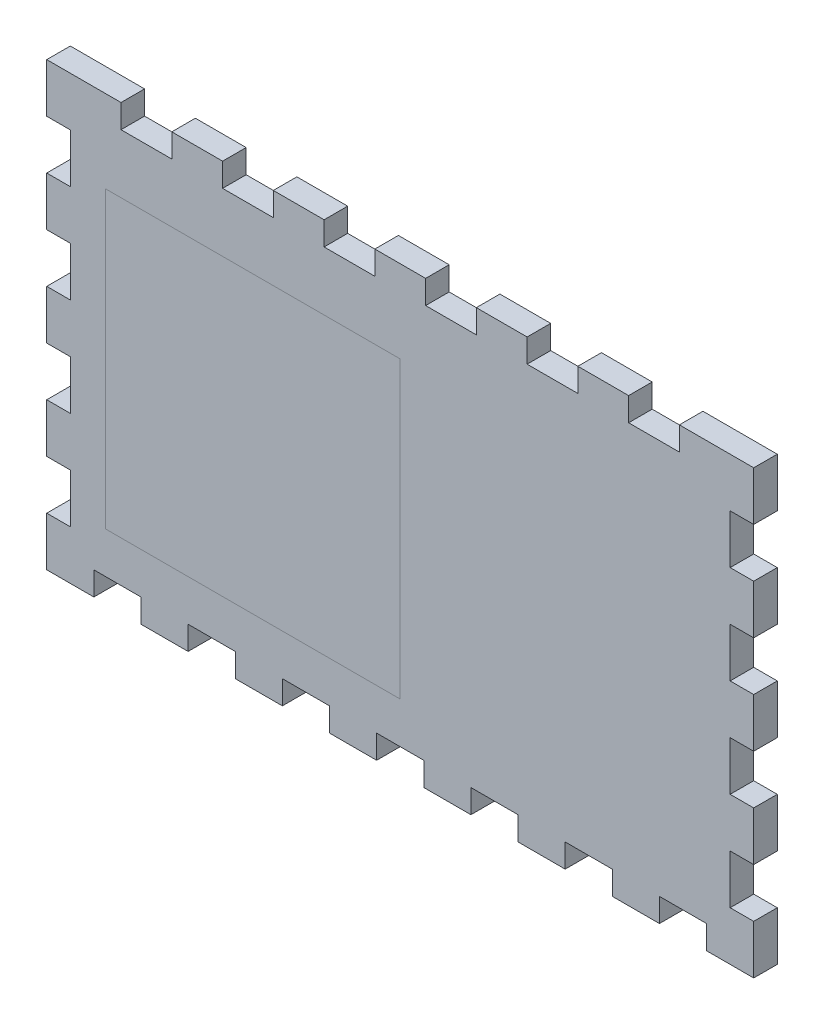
ISO-10303-21;
HEADER;
FILE_DESCRIPTION(('STEP AP214'),'2;1');
FILE_NAME('part.step','',(''),(''),'','','');
FILE_SCHEMA(('AUTOMOTIVE_DESIGN { 1 0 10303 214 1 1 1 1 }'));
ENDSEC;
DATA;
#1=APPLICATION_CONTEXT('core data for automotive mechanical design processes');
#2=APPLICATION_PROTOCOL_DEFINITION('international standard','automotive_design',2000,#1);
#3=PRODUCT_CONTEXT('',#1,'mechanical');
#4=PRODUCT('Part','Part','',(#3));
#5=PRODUCT_RELATED_PRODUCT_CATEGORY('part','',(#4));
#6=PRODUCT_DEFINITION_FORMATION('','',#4);
#7=PRODUCT_DEFINITION_CONTEXT('part definition',#1,'design');
#8=PRODUCT_DEFINITION('design','',#6,#7);
#9=PRODUCT_DEFINITION_SHAPE('','',#8);
#10=(LENGTH_UNIT() NAMED_UNIT(*) SI_UNIT(.MILLI.,.METRE.));
#11=(NAMED_UNIT(*) PLANE_ANGLE_UNIT() SI_UNIT($,.RADIAN.));
#12=(NAMED_UNIT(*) SI_UNIT($,.STERADIAN.) SOLID_ANGLE_UNIT());
#13=UNCERTAINTY_MEASURE_WITH_UNIT(LENGTH_MEASURE(1.E-05),#10,'distance_accuracy_value','');
#14=(GEOMETRIC_REPRESENTATION_CONTEXT(3) GLOBAL_UNCERTAINTY_ASSIGNED_CONTEXT((#13)) GLOBAL_UNIT_ASSIGNED_CONTEXT((#10,
#11,#12)) REPRESENTATION_CONTEXT('',''));
#15=CARTESIAN_POINT('',(0.,0.,0.));
#16=DIRECTION('',(0.,0.,1.));
#17=DIRECTION('',(1.,0.,0.));
#18=AXIS2_PLACEMENT_3D('',#15,#16,#17);
#19=CARTESIAN_POINT('',(0.,0.,0.));
#20=DIRECTION('',(0.,0.,1.));
#21=DIRECTION('',(1.,0.,0.));
#22=AXIS2_PLACEMENT_3D('',#19,#20,#21);
#23=PLANE('',#22);
#24=DIRECTION('',(1.,0.,0.));
#25=VECTOR('',#24,1.);
#26=CARTESIAN_POINT('',(0.,278.,0.));
#27=LINE('',#26,#25);
#28=CARTESIAN_POINT('',(79.,278.,0.));
#29=VERTEX_POINT('',#28);
#30=CARTESIAN_POINT('',(91.61,278.,0.));
#31=VERTEX_POINT('',#30);
#32=EDGE_CURVE('E610',#29,#31,#27,.T.);
#33=ORIENTED_EDGE('',*,*,#32,.T.);
#34=DIRECTION('',(0.,-1.,0.));
#35=VECTOR('',#34,1.);
#36=CARTESIAN_POINT('',(91.61,0.,0.));
#37=LINE('',#36,#35);
#38=CARTESIAN_POINT('',(91.61,274.,0.));
#39=VERTEX_POINT('',#38);
#40=EDGE_CURVE('E628',#31,#39,#37,.T.);
#41=ORIENTED_EDGE('',*,*,#40,.T.);
#42=DIRECTION('',(1.,0.,0.));
#43=VECTOR('',#42,1.);
#44=CARTESIAN_POINT('',(0.,274.,0.));
#45=LINE('',#44,#43);
#46=CARTESIAN_POINT('',(100.23,274.,0.));
#47=VERTEX_POINT('',#46);
#48=EDGE_CURVE('E1144',#39,#47,#45,.T.);
#49=ORIENTED_EDGE('',*,*,#48,.T.);
#50=DIRECTION('',(0.,1.,0.));
#51=VECTOR('',#50,1.);
#52=CARTESIAN_POINT('',(100.23,0.,0.));
#53=LINE('',#52,#51);
#54=CARTESIAN_POINT('',(100.23,278.,0.));
#55=VERTEX_POINT('',#54);
#56=EDGE_CURVE('E1141',#47,#55,#53,.T.);
#57=ORIENTED_EDGE('',*,*,#56,.T.);
#58=DIRECTION('',(1.,0.,0.));
#59=VECTOR('',#58,1.);
#60=CARTESIAN_POINT('',(0.,278.,0.));
#61=LINE('',#60,#59);
#62=CARTESIAN_POINT('',(108.85,278.,0.));
#63=VERTEX_POINT('',#62);
#64=EDGE_CURVE('E1138',#55,#63,#61,.T.);
#65=ORIENTED_EDGE('',*,*,#64,.T.);
#66=DIRECTION('',(0.,-1.,0.));
#67=VECTOR('',#66,1.);
#68=CARTESIAN_POINT('',(108.85,0.,0.));
#69=LINE('',#68,#67);
#70=CARTESIAN_POINT('',(108.85,274.,0.));
#71=VERTEX_POINT('',#70);
#72=EDGE_CURVE('E1135',#63,#71,#69,.T.);
#73=ORIENTED_EDGE('',*,*,#72,.T.);
#74=DIRECTION('',(1.,0.,0.));
#75=VECTOR('',#74,1.);
#76=CARTESIAN_POINT('',(0.,274.,0.));
#77=LINE('',#76,#75);
#78=CARTESIAN_POINT('',(117.46,274.,0.));
#79=VERTEX_POINT('',#78);
#80=EDGE_CURVE('E1132',#71,#79,#77,.T.);
#81=ORIENTED_EDGE('',*,*,#80,.T.);
#82=DIRECTION('',(0.,1.,0.));
#83=VECTOR('',#82,1.);
#84=CARTESIAN_POINT('',(117.46,0.,0.));
#85=LINE('',#84,#83);
#86=CARTESIAN_POINT('',(117.46,278.,0.));
#87=VERTEX_POINT('',#86);
#88=EDGE_CURVE('E1129',#79,#87,#85,.T.);
#89=ORIENTED_EDGE('',*,*,#88,.T.);
#90=DIRECTION('',(1.,0.,0.));
#91=VECTOR('',#90,1.);
#92=CARTESIAN_POINT('',(0.,278.,0.));
#93=LINE('',#92,#91);
#94=CARTESIAN_POINT('',(126.08,278.,0.));
#95=VERTEX_POINT('',#94);
#96=EDGE_CURVE('E1126',#87,#95,#93,.T.);
#97=ORIENTED_EDGE('',*,*,#96,.T.);
#98=DIRECTION('',(0.,-1.,0.));
#99=VECTOR('',#98,1.);
#100=CARTESIAN_POINT('',(126.08,0.,0.));
#101=LINE('',#100,#99);
#102=CARTESIAN_POINT('',(126.08,274.,0.));
#103=VERTEX_POINT('',#102);
#104=EDGE_CURVE('E1123',#95,#103,#101,.T.);
#105=ORIENTED_EDGE('',*,*,#104,.T.);
#106=DIRECTION('',(1.,0.,0.));
#107=VECTOR('',#106,1.);
#108=CARTESIAN_POINT('',(0.,274.,0.));
#109=LINE('',#108,#107);
#110=CARTESIAN_POINT('',(134.69,274.,0.));
#111=VERTEX_POINT('',#110);
#112=EDGE_CURVE('E1120',#103,#111,#109,.T.);
#113=ORIENTED_EDGE('',*,*,#112,.T.);
#114=DIRECTION('',(0.,1.,0.));
#115=VECTOR('',#114,1.);
#116=CARTESIAN_POINT('',(134.69,0.,0.));
#117=LINE('',#116,#115);
#118=CARTESIAN_POINT('',(134.69,278.,0.));
#119=VERTEX_POINT('',#118);
#120=EDGE_CURVE('E1117',#111,#119,#117,.T.);
#121=ORIENTED_EDGE('',*,*,#120,.T.);
#122=DIRECTION('',(1.,0.,0.));
#123=VECTOR('',#122,1.);
#124=CARTESIAN_POINT('',(0.,278.,0.));
#125=LINE('',#124,#123);
#126=CARTESIAN_POINT('',(143.31,278.,0.));
#127=VERTEX_POINT('',#126);
#128=EDGE_CURVE('E1114',#119,#127,#125,.T.);
#129=ORIENTED_EDGE('',*,*,#128,.T.);
#130=DIRECTION('',(0.,-1.,0.));
#131=VECTOR('',#130,1.);
#132=CARTESIAN_POINT('',(143.31,0.,0.));
#133=LINE('',#132,#131);
#134=CARTESIAN_POINT('',(143.31,274.,0.));
#135=VERTEX_POINT('',#134);
#136=EDGE_CURVE('E1111',#127,#135,#133,.T.);
#137=ORIENTED_EDGE('',*,*,#136,.T.);
#138=DIRECTION('',(1.,0.,0.));
#139=VECTOR('',#138,1.);
#140=CARTESIAN_POINT('',(0.,274.,0.));
#141=LINE('',#140,#139);
#142=CARTESIAN_POINT('',(151.92,274.,0.));
#143=VERTEX_POINT('',#142);
#144=EDGE_CURVE('E1108',#135,#143,#141,.T.);
#145=ORIENTED_EDGE('',*,*,#144,.T.);
#146=DIRECTION('',(0.,1.,0.));
#147=VECTOR('',#146,1.);
#148=CARTESIAN_POINT('',(151.92,0.,0.));
#149=LINE('',#148,#147);
#150=CARTESIAN_POINT('',(151.92,278.,0.));
#151=VERTEX_POINT('',#150);
#152=EDGE_CURVE('E1105',#143,#151,#149,.T.);
#153=ORIENTED_EDGE('',*,*,#152,.T.);
#154=DIRECTION('',(1.,0.,0.));
#155=VECTOR('',#154,1.);
#156=CARTESIAN_POINT('',(0.,278.,0.));
#157=LINE('',#156,#155);
#158=CARTESIAN_POINT('',(160.54,278.,0.));
#159=VERTEX_POINT('',#158);
#160=EDGE_CURVE('E1102',#151,#159,#157,.T.);
#161=ORIENTED_EDGE('',*,*,#160,.T.);
#162=DIRECTION('',(0.,-1.,0.));
#163=VECTOR('',#162,1.);
#164=CARTESIAN_POINT('',(160.54,0.,0.));
#165=LINE('',#164,#163);
#166=CARTESIAN_POINT('',(160.54,274.,0.));
#167=VERTEX_POINT('',#166);
#168=EDGE_CURVE('E1099',#159,#167,#165,.T.);
#169=ORIENTED_EDGE('',*,*,#168,.T.);
#170=DIRECTION('',(1.,0.,0.));
#171=VECTOR('',#170,1.);
#172=CARTESIAN_POINT('',(0.,274.,0.));
#173=LINE('',#172,#171);
#174=CARTESIAN_POINT('',(169.15,274.,0.));
#175=VERTEX_POINT('',#174);
#176=EDGE_CURVE('E1096',#167,#175,#173,.T.);
#177=ORIENTED_EDGE('',*,*,#176,.T.);
#178=DIRECTION('',(0.,1.,0.));
#179=VECTOR('',#178,1.);
#180=CARTESIAN_POINT('',(169.15,0.,0.));
#181=LINE('',#180,#179);
#182=CARTESIAN_POINT('',(169.15,278.,0.));
#183=VERTEX_POINT('',#182);
#184=EDGE_CURVE('E1093',#175,#183,#181,.T.);
#185=ORIENTED_EDGE('',*,*,#184,.T.);
#186=DIRECTION('',(1.,0.,0.));
#187=VECTOR('',#186,1.);
#188=CARTESIAN_POINT('',(0.,278.,0.));
#189=LINE('',#188,#187);
#190=CARTESIAN_POINT('',(177.77,278.,0.));
#191=VERTEX_POINT('',#190);
#192=EDGE_CURVE('E1090',#183,#191,#189,.T.);
#193=ORIENTED_EDGE('',*,*,#192,.T.);
#194=DIRECTION('',(0.,-1.,0.));
#195=VECTOR('',#194,1.);
#196=CARTESIAN_POINT('',(177.77,0.,0.));
#197=LINE('',#196,#195);
#198=CARTESIAN_POINT('',(177.77,274.,0.));
#199=VERTEX_POINT('',#198);
#200=EDGE_CURVE('E1087',#191,#199,#197,.T.);
#201=ORIENTED_EDGE('',*,*,#200,.T.);
#202=DIRECTION('',(1.,0.,0.));
#203=VECTOR('',#202,1.);
#204=CARTESIAN_POINT('',(0.,274.,0.));
#205=LINE('',#204,#203);
#206=CARTESIAN_POINT('',(186.38,274.,0.));
#207=VERTEX_POINT('',#206);
#208=EDGE_CURVE('E1084',#199,#207,#205,.T.);
#209=ORIENTED_EDGE('',*,*,#208,.T.);
#210=DIRECTION('',(0.,1.,0.));
#211=VECTOR('',#210,1.);
#212=CARTESIAN_POINT('',(186.38,0.,0.));
#213=LINE('',#212,#211);
#214=CARTESIAN_POINT('',(186.38,278.,0.));
#215=VERTEX_POINT('',#214);
#216=EDGE_CURVE('E1081',#207,#215,#213,.T.);
#217=ORIENTED_EDGE('',*,*,#216,.T.);
#218=DIRECTION('',(1.,0.,0.));
#219=VECTOR('',#218,1.);
#220=CARTESIAN_POINT('',(0.,278.,0.));
#221=LINE('',#220,#219);
#222=CARTESIAN_POINT('',(199.,278.,0.));
#223=VERTEX_POINT('',#222);
#224=EDGE_CURVE('E1078',#215,#223,#221,.T.);
#225=ORIENTED_EDGE('',*,*,#224,.T.);
#226=DIRECTION('',(0.,-1.,0.));
#227=VECTOR('',#226,1.);
#228=CARTESIAN_POINT('',(199.,0.,0.));
#229=LINE('',#228,#227);
#230=CARTESIAN_POINT('',(199.,269.67,0.));
#231=VERTEX_POINT('',#230);
#232=EDGE_CURVE('E1075',#223,#231,#229,.T.);
#233=ORIENTED_EDGE('',*,*,#232,.T.);
#234=DIRECTION('',(-1.,0.,0.));
#235=VECTOR('',#234,1.);
#236=CARTESIAN_POINT('',(0.,269.67,0.));
#237=LINE('',#236,#235);
#238=CARTESIAN_POINT('',(195.,269.67,0.));
#239=VERTEX_POINT('',#238);
#240=EDGE_CURVE('E1072',#231,#239,#237,.T.);
#241=ORIENTED_EDGE('',*,*,#240,.T.);
#242=DIRECTION('',(0.,-1.,0.));
#243=VECTOR('',#242,1.);
#244=CARTESIAN_POINT('',(195.,0.,0.));
#245=LINE('',#244,#243);
#246=CARTESIAN_POINT('',(195.,261.33,0.));
#247=VERTEX_POINT('',#246);
#248=EDGE_CURVE('E1069',#239,#247,#245,.T.);
#249=ORIENTED_EDGE('',*,*,#248,.T.);
#250=DIRECTION('',(1.,0.,0.));
#251=VECTOR('',#250,1.);
#252=CARTESIAN_POINT('',(0.,261.33,0.));
#253=LINE('',#252,#251);
#254=CARTESIAN_POINT('',(199.,261.33,0.));
#255=VERTEX_POINT('',#254);
#256=EDGE_CURVE('E1066',#247,#255,#253,.T.);
#257=ORIENTED_EDGE('',*,*,#256,.T.);
#258=DIRECTION('',(0.,-1.,0.));
#259=VECTOR('',#258,1.);
#260=CARTESIAN_POINT('',(199.,0.,0.));
#261=LINE('',#260,#259);
#262=CARTESIAN_POINT('',(199.,253.,0.));
#263=VERTEX_POINT('',#262);
#264=EDGE_CURVE('E1063',#255,#263,#261,.T.);
#265=ORIENTED_EDGE('',*,*,#264,.T.);
#266=DIRECTION('',(-1.,0.,0.));
#267=VECTOR('',#266,1.);
#268=CARTESIAN_POINT('',(0.,253.,0.));
#269=LINE('',#268,#267);
#270=CARTESIAN_POINT('',(195.,253.,0.));
#271=VERTEX_POINT('',#270);
#272=EDGE_CURVE('E1060',#263,#271,#269,.T.);
#273=ORIENTED_EDGE('',*,*,#272,.T.);
#274=DIRECTION('',(0.,-1.,0.));
#275=VECTOR('',#274,1.);
#276=CARTESIAN_POINT('',(195.,0.,0.));
#277=LINE('',#276,#275);
#278=CARTESIAN_POINT('',(195.,244.67,0.));
#279=VERTEX_POINT('',#278);
#280=EDGE_CURVE('E1057',#271,#279,#277,.T.);
#281=ORIENTED_EDGE('',*,*,#280,.T.);
#282=DIRECTION('',(1.,0.,0.));
#283=VECTOR('',#282,1.);
#284=CARTESIAN_POINT('',(0.,244.67,0.));
#285=LINE('',#284,#283);
#286=CARTESIAN_POINT('',(199.,244.67,0.));
#287=VERTEX_POINT('',#286);
#288=EDGE_CURVE('E1054',#279,#287,#285,.T.);
#289=ORIENTED_EDGE('',*,*,#288,.T.);
#290=DIRECTION('',(0.,-1.,0.));
#291=VECTOR('',#290,1.);
#292=CARTESIAN_POINT('',(199.,0.,0.));
#293=LINE('',#292,#291);
#294=CARTESIAN_POINT('',(199.,236.33,0.));
#295=VERTEX_POINT('',#294);
#296=EDGE_CURVE('E1051',#287,#295,#293,.T.);
#297=ORIENTED_EDGE('',*,*,#296,.T.);
#298=DIRECTION('',(-1.,0.,0.));
#299=VECTOR('',#298,1.);
#300=CARTESIAN_POINT('',(0.,236.33,0.));
#301=LINE('',#300,#299);
#302=CARTESIAN_POINT('',(195.,236.33,0.));
#303=VERTEX_POINT('',#302);
#304=EDGE_CURVE('E1048',#295,#303,#301,.T.);
#305=ORIENTED_EDGE('',*,*,#304,.T.);
#306=DIRECTION('',(0.,-1.,0.));
#307=VECTOR('',#306,1.);
#308=CARTESIAN_POINT('',(195.,0.,0.));
#309=LINE('',#308,#307);
#310=CARTESIAN_POINT('',(195.,228.,0.));
#311=VERTEX_POINT('',#310);
#312=EDGE_CURVE('E1045',#303,#311,#309,.T.);
#313=ORIENTED_EDGE('',*,*,#312,.T.);
#314=DIRECTION('',(1.,0.,0.));
#315=VECTOR('',#314,1.);
#316=CARTESIAN_POINT('',(0.,228.,0.));
#317=LINE('',#316,#315);
#318=CARTESIAN_POINT('',(199.,228.,0.));
#319=VERTEX_POINT('',#318);
#320=EDGE_CURVE('E1042',#311,#319,#317,.T.);
#321=ORIENTED_EDGE('',*,*,#320,.T.);
#322=DIRECTION('',(0.,-1.,0.));
#323=VECTOR('',#322,1.);
#324=CARTESIAN_POINT('',(199.,0.,0.));
#325=LINE('',#324,#323);
#326=CARTESIAN_POINT('',(199.,219.67,0.));
#327=VERTEX_POINT('',#326);
#328=EDGE_CURVE('E1039',#319,#327,#325,.T.);
#329=ORIENTED_EDGE('',*,*,#328,.T.);
#330=DIRECTION('',(-1.,0.,0.));
#331=VECTOR('',#330,1.);
#332=CARTESIAN_POINT('',(0.,219.67,0.));
#333=LINE('',#332,#331);
#334=CARTESIAN_POINT('',(195.,219.67,0.));
#335=VERTEX_POINT('',#334);
#336=EDGE_CURVE('E1036',#327,#335,#333,.T.);
#337=ORIENTED_EDGE('',*,*,#336,.T.);
#338=DIRECTION('',(0.,-1.,0.));
#339=VECTOR('',#338,1.);
#340=CARTESIAN_POINT('',(195.,0.,0.));
#341=LINE('',#340,#339);
#342=CARTESIAN_POINT('',(195.,211.33,0.));
#343=VERTEX_POINT('',#342);
#344=EDGE_CURVE('E1033',#335,#343,#341,.T.);
#345=ORIENTED_EDGE('',*,*,#344,.T.);
#346=DIRECTION('',(1.,0.,0.));
#347=VECTOR('',#346,1.);
#348=CARTESIAN_POINT('',(0.,211.33,0.));
#349=LINE('',#348,#347);
#350=CARTESIAN_POINT('',(199.,211.33,0.));
#351=VERTEX_POINT('',#350);
#352=EDGE_CURVE('E1030',#343,#351,#349,.T.);
#353=ORIENTED_EDGE('',*,*,#352,.T.);
#354=DIRECTION('',(0.,-1.,0.));
#355=VECTOR('',#354,1.);
#356=CARTESIAN_POINT('',(199.,0.,0.));
#357=LINE('',#356,#355);
#358=CARTESIAN_POINT('',(199.,203.,0.));
#359=VERTEX_POINT('',#358);
#360=EDGE_CURVE('E1027',#351,#359,#357,.T.);
#361=ORIENTED_EDGE('',*,*,#360,.T.);
#362=DIRECTION('',(-1.,0.,0.));
#363=VECTOR('',#362,1.);
#364=CARTESIAN_POINT('',(0.,203.,0.));
#365=LINE('',#364,#363);
#366=CARTESIAN_POINT('',(191.,203.,0.));
#367=VERTEX_POINT('',#366);
#368=EDGE_CURVE('E1024',#359,#367,#365,.T.);
#369=ORIENTED_EDGE('',*,*,#368,.T.);
#370=DIRECTION('',(0.,1.,0.));
#371=VECTOR('',#370,1.);
#372=CARTESIAN_POINT('',(191.,0.,0.));
#373=LINE('',#372,#371);
#374=CARTESIAN_POINT('',(191.,207.,0.));
#375=VERTEX_POINT('',#374);
#376=EDGE_CURVE('E1021',#367,#375,#373,.T.);
#377=ORIENTED_EDGE('',*,*,#376,.T.);
#378=DIRECTION('',(-1.,0.,0.));
#379=VECTOR('',#378,1.);
#380=CARTESIAN_POINT('',(0.,207.,0.));
#381=LINE('',#380,#379);
#382=CARTESIAN_POINT('',(183.,207.,0.));
#383=VERTEX_POINT('',#382);
#384=EDGE_CURVE('E1018',#375,#383,#381,.T.);
#385=ORIENTED_EDGE('',*,*,#384,.T.);
#386=DIRECTION('',(0.,-1.,0.));
#387=VECTOR('',#386,1.);
#388=CARTESIAN_POINT('',(183.,0.,0.));
#389=LINE('',#388,#387);
#390=CARTESIAN_POINT('',(183.,203.,0.));
#391=VERTEX_POINT('',#390);
#392=EDGE_CURVE('E1015',#383,#391,#389,.T.);
#393=ORIENTED_EDGE('',*,*,#392,.T.);
#394=DIRECTION('',(-1.,0.,0.));
#395=VECTOR('',#394,1.);
#396=CARTESIAN_POINT('',(0.,203.,0.));
#397=LINE('',#396,#395);
#398=CARTESIAN_POINT('',(175.,203.,0.));
#399=VERTEX_POINT('',#398);
#400=EDGE_CURVE('E1012',#391,#399,#397,.T.);
#401=ORIENTED_EDGE('',*,*,#400,.T.);
#402=DIRECTION('',(0.,1.,0.));
#403=VECTOR('',#402,1.);
#404=CARTESIAN_POINT('',(175.,0.,0.));
#405=LINE('',#404,#403);
#406=CARTESIAN_POINT('',(175.,207.,0.));
#407=VERTEX_POINT('',#406);
#408=EDGE_CURVE('E1009',#399,#407,#405,.T.);
#409=ORIENTED_EDGE('',*,*,#408,.T.);
#410=DIRECTION('',(-1.,0.,0.));
#411=VECTOR('',#410,1.);
#412=CARTESIAN_POINT('',(0.,207.,0.));
#413=LINE('',#412,#411);
#414=CARTESIAN_POINT('',(167.,207.,0.));
#415=VERTEX_POINT('',#414);
#416=EDGE_CURVE('E1006',#407,#415,#413,.T.);
#417=ORIENTED_EDGE('',*,*,#416,.T.);
#418=DIRECTION('',(0.,-1.,0.));
#419=VECTOR('',#418,1.);
#420=CARTESIAN_POINT('',(167.,0.,0.));
#421=LINE('',#420,#419);
#422=CARTESIAN_POINT('',(167.,203.,0.));
#423=VERTEX_POINT('',#422);
#424=EDGE_CURVE('E1003',#415,#423,#421,.T.);
#425=ORIENTED_EDGE('',*,*,#424,.T.);
#426=DIRECTION('',(-1.,0.,0.));
#427=VECTOR('',#426,1.);
#428=CARTESIAN_POINT('',(0.,203.,0.));
#429=LINE('',#428,#427);
#430=CARTESIAN_POINT('',(159.,203.,0.));
#431=VERTEX_POINT('',#430);
#432=EDGE_CURVE('E1000',#423,#431,#429,.T.);
#433=ORIENTED_EDGE('',*,*,#432,.T.);
#434=DIRECTION('',(0.,1.,0.));
#435=VECTOR('',#434,1.);
#436=CARTESIAN_POINT('',(159.,0.,0.));
#437=LINE('',#436,#435);
#438=CARTESIAN_POINT('',(159.,207.,0.));
#439=VERTEX_POINT('',#438);
#440=EDGE_CURVE('E997',#431,#439,#437,.T.);
#441=ORIENTED_EDGE('',*,*,#440,.T.);
#442=DIRECTION('',(-1.,0.,0.));
#443=VECTOR('',#442,1.);
#444=CARTESIAN_POINT('',(0.,207.,0.));
#445=LINE('',#444,#443);
#446=CARTESIAN_POINT('',(151.,207.,0.));
#447=VERTEX_POINT('',#446);
#448=EDGE_CURVE('E994',#439,#447,#445,.T.);
#449=ORIENTED_EDGE('',*,*,#448,.T.);
#450=DIRECTION('',(0.,-1.,0.));
#451=VECTOR('',#450,1.);
#452=CARTESIAN_POINT('',(151.,0.,0.));
#453=LINE('',#452,#451);
#454=CARTESIAN_POINT('',(151.,203.,0.));
#455=VERTEX_POINT('',#454);
#456=EDGE_CURVE('E991',#447,#455,#453,.T.);
#457=ORIENTED_EDGE('',*,*,#456,.T.);
#458=DIRECTION('',(-1.,0.,0.));
#459=VECTOR('',#458,1.);
#460=CARTESIAN_POINT('',(0.,203.,0.));
#461=LINE('',#460,#459);
#462=CARTESIAN_POINT('',(143.,203.,0.));
#463=VERTEX_POINT('',#462);
#464=EDGE_CURVE('E988',#455,#463,#461,.T.);
#465=ORIENTED_EDGE('',*,*,#464,.T.);
#466=DIRECTION('',(0.,1.,0.));
#467=VECTOR('',#466,1.);
#468=CARTESIAN_POINT('',(143.,0.,0.));
#469=LINE('',#468,#467);
#470=CARTESIAN_POINT('',(143.,207.,0.));
#471=VERTEX_POINT('',#470);
#472=EDGE_CURVE('E985',#463,#471,#469,.T.);
#473=ORIENTED_EDGE('',*,*,#472,.T.);
#474=DIRECTION('',(-1.,0.,0.));
#475=VECTOR('',#474,1.);
#476=CARTESIAN_POINT('',(0.,207.,0.));
#477=LINE('',#476,#475);
#478=CARTESIAN_POINT('',(135.,207.,0.));
#479=VERTEX_POINT('',#478);
#480=EDGE_CURVE('E982',#471,#479,#477,.T.);
#481=ORIENTED_EDGE('',*,*,#480,.T.);
#482=DIRECTION('',(0.,-1.,0.));
#483=VECTOR('',#482,1.);
#484=CARTESIAN_POINT('',(135.,0.,0.));
#485=LINE('',#484,#483);
#486=CARTESIAN_POINT('',(135.,203.,0.));
#487=VERTEX_POINT('',#486);
#488=EDGE_CURVE('E979',#479,#487,#485,.T.);
#489=ORIENTED_EDGE('',*,*,#488,.T.);
#490=DIRECTION('',(-1.,0.,0.));
#491=VECTOR('',#490,1.);
#492=CARTESIAN_POINT('',(0.,203.,0.));
#493=LINE('',#492,#491);
#494=CARTESIAN_POINT('',(127.,203.,0.));
#495=VERTEX_POINT('',#494);
#496=EDGE_CURVE('E976',#487,#495,#493,.T.);
#497=ORIENTED_EDGE('',*,*,#496,.T.);
#498=DIRECTION('',(0.,1.,0.));
#499=VECTOR('',#498,1.);
#500=CARTESIAN_POINT('',(127.,0.,0.));
#501=LINE('',#500,#499);
#502=CARTESIAN_POINT('',(127.,207.,0.));
#503=VERTEX_POINT('',#502);
#504=EDGE_CURVE('E973',#495,#503,#501,.T.);
#505=ORIENTED_EDGE('',*,*,#504,.T.);
#506=DIRECTION('',(-1.,0.,0.));
#507=VECTOR('',#506,1.);
#508=CARTESIAN_POINT('',(0.,207.,0.));
#509=LINE('',#508,#507);
#510=CARTESIAN_POINT('',(119.,207.,0.));
#511=VERTEX_POINT('',#510);
#512=EDGE_CURVE('E970',#503,#511,#509,.T.);
#513=ORIENTED_EDGE('',*,*,#512,.T.);
#514=DIRECTION('',(0.,-1.,0.));
#515=VECTOR('',#514,1.);
#516=CARTESIAN_POINT('',(119.,0.,0.));
#517=LINE('',#516,#515);
#518=CARTESIAN_POINT('',(119.,203.,0.));
#519=VERTEX_POINT('',#518);
#520=EDGE_CURVE('E967',#511,#519,#517,.T.);
#521=ORIENTED_EDGE('',*,*,#520,.T.);
#522=DIRECTION('',(-1.,0.,0.));
#523=VECTOR('',#522,1.);
#524=CARTESIAN_POINT('',(0.,203.,0.));
#525=LINE('',#524,#523);
#526=CARTESIAN_POINT('',(111.,203.,0.));
#527=VERTEX_POINT('',#526);
#528=EDGE_CURVE('E964',#519,#527,#525,.T.);
#529=ORIENTED_EDGE('',*,*,#528,.T.);
#530=DIRECTION('',(0.,1.,0.));
#531=VECTOR('',#530,1.);
#532=CARTESIAN_POINT('',(111.,0.,0.));
#533=LINE('',#532,#531);
#534=CARTESIAN_POINT('',(111.,207.,0.));
#535=VERTEX_POINT('',#534);
#536=EDGE_CURVE('E961',#527,#535,#533,.T.);
#537=ORIENTED_EDGE('',*,*,#536,.T.);
#538=DIRECTION('',(-1.,0.,0.));
#539=VECTOR('',#538,1.);
#540=CARTESIAN_POINT('',(0.,207.,0.));
#541=LINE('',#540,#539);
#542=CARTESIAN_POINT('',(103.,207.,0.));
#543=VERTEX_POINT('',#542);
#544=EDGE_CURVE('E958',#535,#543,#541,.T.);
#545=ORIENTED_EDGE('',*,*,#544,.T.);
#546=DIRECTION('',(0.,-1.,0.));
#547=VECTOR('',#546,1.);
#548=CARTESIAN_POINT('',(103.,0.,0.));
#549=LINE('',#548,#547);
#550=CARTESIAN_POINT('',(103.,203.,0.));
#551=VERTEX_POINT('',#550);
#552=EDGE_CURVE('E955',#543,#551,#549,.T.);
#553=ORIENTED_EDGE('',*,*,#552,.T.);
#554=DIRECTION('',(-1.,0.,0.));
#555=VECTOR('',#554,1.);
#556=CARTESIAN_POINT('',(0.,203.,0.));
#557=LINE('',#556,#555);
#558=CARTESIAN_POINT('',(95.,203.,0.));
#559=VERTEX_POINT('',#558);
#560=EDGE_CURVE('E952',#551,#559,#557,.T.);
#561=ORIENTED_EDGE('',*,*,#560,.T.);
#562=DIRECTION('',(0.,1.,0.));
#563=VECTOR('',#562,1.);
#564=CARTESIAN_POINT('',(95.,0.,0.));
#565=LINE('',#564,#563);
#566=CARTESIAN_POINT('',(95.,207.,0.));
#567=VERTEX_POINT('',#566);
#568=EDGE_CURVE('E949',#559,#567,#565,.T.);
#569=ORIENTED_EDGE('',*,*,#568,.T.);
#570=DIRECTION('',(-1.,0.,0.));
#571=VECTOR('',#570,1.);
#572=CARTESIAN_POINT('',(0.,207.,0.));
#573=LINE('',#572,#571);
#574=CARTESIAN_POINT('',(87.,207.,0.));
#575=VERTEX_POINT('',#574);
#576=EDGE_CURVE('E946',#567,#575,#573,.T.);
#577=ORIENTED_EDGE('',*,*,#576,.T.);
#578=DIRECTION('',(0.,-1.,0.));
#579=VECTOR('',#578,1.);
#580=CARTESIAN_POINT('',(87.,0.,0.));
#581=LINE('',#580,#579);
#582=CARTESIAN_POINT('',(87.,203.,0.));
#583=VERTEX_POINT('',#582);
#584=EDGE_CURVE('E943',#575,#583,#581,.T.);
#585=ORIENTED_EDGE('',*,*,#584,.T.);
#586=DIRECTION('',(-1.,0.,0.));
#587=VECTOR('',#586,1.);
#588=CARTESIAN_POINT('',(0.,203.,0.));
#589=LINE('',#588,#587);
#590=CARTESIAN_POINT('',(79.,203.,0.));
#591=VERTEX_POINT('',#590);
#592=EDGE_CURVE('E940',#583,#591,#589,.T.);
#593=ORIENTED_EDGE('',*,*,#592,.T.);
#594=DIRECTION('',(0.,1.,0.));
#595=VECTOR('',#594,1.);
#596=CARTESIAN_POINT('',(79.,0.,0.));
#597=LINE('',#596,#595);
#598=CARTESIAN_POINT('',(79.,211.33,0.));
#599=VERTEX_POINT('',#598);
#600=EDGE_CURVE('E937',#591,#599,#597,.T.);
#601=ORIENTED_EDGE('',*,*,#600,.T.);
#602=DIRECTION('',(1.,0.,0.));
#603=VECTOR('',#602,1.);
#604=CARTESIAN_POINT('',(0.,211.33,0.));
#605=LINE('',#604,#603);
#606=CARTESIAN_POINT('',(83.,211.33,0.));
#607=VERTEX_POINT('',#606);
#608=EDGE_CURVE('E934',#599,#607,#605,.T.);
#609=ORIENTED_EDGE('',*,*,#608,.T.);
#610=DIRECTION('',(0.,1.,0.));
#611=VECTOR('',#610,1.);
#612=CARTESIAN_POINT('',(83.,0.,0.));
#613=LINE('',#612,#611);
#614=CARTESIAN_POINT('',(83.,219.67,0.));
#615=VERTEX_POINT('',#614);
#616=EDGE_CURVE('E931',#607,#615,#613,.T.);
#617=ORIENTED_EDGE('',*,*,#616,.T.);
#618=DIRECTION('',(-1.,0.,0.));
#619=VECTOR('',#618,1.);
#620=CARTESIAN_POINT('',(0.,219.67,0.));
#621=LINE('',#620,#619);
#622=CARTESIAN_POINT('',(79.,219.67,0.));
#623=VERTEX_POINT('',#622);
#624=EDGE_CURVE('E928',#615,#623,#621,.T.);
#625=ORIENTED_EDGE('',*,*,#624,.T.);
#626=DIRECTION('',(0.,1.,0.));
#627=VECTOR('',#626,1.);
#628=CARTESIAN_POINT('',(79.,0.,0.));
#629=LINE('',#628,#627);
#630=CARTESIAN_POINT('',(79.,228.,0.));
#631=VERTEX_POINT('',#630);
#632=EDGE_CURVE('E925',#623,#631,#629,.T.);
#633=ORIENTED_EDGE('',*,*,#632,.T.);
#634=DIRECTION('',(1.,0.,0.));
#635=VECTOR('',#634,1.);
#636=CARTESIAN_POINT('',(0.,228.,0.));
#637=LINE('',#636,#635);
#638=CARTESIAN_POINT('',(83.,228.,0.));
#639=VERTEX_POINT('',#638);
#640=EDGE_CURVE('E922',#631,#639,#637,.T.);
#641=ORIENTED_EDGE('',*,*,#640,.T.);
#642=DIRECTION('',(0.,1.,0.));
#643=VECTOR('',#642,1.);
#644=CARTESIAN_POINT('',(83.,0.,0.));
#645=LINE('',#644,#643);
#646=CARTESIAN_POINT('',(83.,236.33,0.));
#647=VERTEX_POINT('',#646);
#648=EDGE_CURVE('E919',#639,#647,#645,.T.);
#649=ORIENTED_EDGE('',*,*,#648,.T.);
#650=DIRECTION('',(-1.,0.,0.));
#651=VECTOR('',#650,1.);
#652=CARTESIAN_POINT('',(0.,236.33,0.));
#653=LINE('',#652,#651);
#654=CARTESIAN_POINT('',(79.,236.33,0.));
#655=VERTEX_POINT('',#654);
#656=EDGE_CURVE('E916',#647,#655,#653,.T.);
#657=ORIENTED_EDGE('',*,*,#656,.T.);
#658=DIRECTION('',(0.,1.,0.));
#659=VECTOR('',#658,1.);
#660=CARTESIAN_POINT('',(79.,0.,0.));
#661=LINE('',#660,#659);
#662=CARTESIAN_POINT('',(79.,244.67,0.));
#663=VERTEX_POINT('',#662);
#664=EDGE_CURVE('E913',#655,#663,#661,.T.);
#665=ORIENTED_EDGE('',*,*,#664,.T.);
#666=DIRECTION('',(1.,0.,0.));
#667=VECTOR('',#666,1.);
#668=CARTESIAN_POINT('',(0.,244.67,0.));
#669=LINE('',#668,#667);
#670=CARTESIAN_POINT('',(83.,244.67,0.));
#671=VERTEX_POINT('',#670);
#672=EDGE_CURVE('E910',#663,#671,#669,.T.);
#673=ORIENTED_EDGE('',*,*,#672,.T.);
#674=DIRECTION('',(0.,1.,0.));
#675=VECTOR('',#674,1.);
#676=CARTESIAN_POINT('',(83.,0.,0.));
#677=LINE('',#676,#675);
#678=CARTESIAN_POINT('',(83.,253.,0.));
#679=VERTEX_POINT('',#678);
#680=EDGE_CURVE('E907',#671,#679,#677,.T.);
#681=ORIENTED_EDGE('',*,*,#680,.T.);
#682=DIRECTION('',(-1.,0.,0.));
#683=VECTOR('',#682,1.);
#684=CARTESIAN_POINT('',(0.,253.,0.));
#685=LINE('',#684,#683);
#686=CARTESIAN_POINT('',(79.,253.,0.));
#687=VERTEX_POINT('',#686);
#688=EDGE_CURVE('E904',#679,#687,#685,.T.);
#689=ORIENTED_EDGE('',*,*,#688,.T.);
#690=DIRECTION('',(0.,1.,0.));
#691=VECTOR('',#690,1.);
#692=CARTESIAN_POINT('',(79.,0.,0.));
#693=LINE('',#692,#691);
#694=CARTESIAN_POINT('',(79.,261.33,0.));
#695=VERTEX_POINT('',#694);
#696=EDGE_CURVE('E901',#687,#695,#693,.T.);
#697=ORIENTED_EDGE('',*,*,#696,.T.);
#698=DIRECTION('',(1.,0.,0.));
#699=VECTOR('',#698,1.);
#700=CARTESIAN_POINT('',(0.,261.33,0.));
#701=LINE('',#700,#699);
#702=CARTESIAN_POINT('',(83.,261.33,0.));
#703=VERTEX_POINT('',#702);
#704=EDGE_CURVE('E898',#695,#703,#701,.T.);
#705=ORIENTED_EDGE('',*,*,#704,.T.);
#706=DIRECTION('',(0.,1.,0.));
#707=VECTOR('',#706,1.);
#708=CARTESIAN_POINT('',(83.,0.,0.));
#709=LINE('',#708,#707);
#710=CARTESIAN_POINT('',(83.,269.67,0.));
#711=VERTEX_POINT('',#710);
#712=EDGE_CURVE('E895',#703,#711,#709,.T.);
#713=ORIENTED_EDGE('',*,*,#712,.T.);
#714=DIRECTION('',(-1.,0.,0.));
#715=VECTOR('',#714,1.);
#716=CARTESIAN_POINT('',(0.,269.67,0.));
#717=LINE('',#716,#715);
#718=CARTESIAN_POINT('',(79.,269.67,0.));
#719=VERTEX_POINT('',#718);
#720=EDGE_CURVE('E892',#711,#719,#717,.T.);
#721=ORIENTED_EDGE('',*,*,#720,.T.);
#722=DIRECTION('',(0.,1.,0.));
#723=VECTOR('',#722,1.);
#724=CARTESIAN_POINT('',(79.,0.,0.));
#725=LINE('',#724,#723);
#726=EDGE_CURVE('E890',#719,#29,#725,.T.);
#727=ORIENTED_EDGE('',*,*,#726,.T.);
#728=EDGE_LOOP('',(#33,#41,#49,#57,#65,#73,#81,#89,#97,#105,#113,#121,#129,#137,#145,#153,#161,
#169,#177,#185,#193,#201,#209,#217,#225,#233,#241,#249,#257,#265,#273,#281,#289,#297,#305,#313,
#321,#329,#337,#345,#353,#361,#369,#377,#385,#393,#401,#409,#417,#425,#433,#441,#449,#457,#465,
#473,#481,#489,#497,#505,#513,#521,#529,#537,#545,#553,#561,#569,#577,#585,#593,#601,#609,#617,
#625,#633,#641,#649,#657,#665,#673,#681,#689,#697,#705,#713,#721,#727));
#729=FACE_BOUND('',#728,.T.);
#730=DIRECTION('',(0.,1.,0.));
#731=VECTOR('',#730,1.);
#732=CARTESIAN_POINT('',(89.,0.,0.));
#733=LINE('',#732,#731);
#734=CARTESIAN_POINT('',(89.,214.,0.));
#735=VERTEX_POINT('',#734);
#736=CARTESIAN_POINT('',(89.,264.,0.));
#737=VERTEX_POINT('',#736);
#738=EDGE_CURVE('E11',#735,#737,#733,.T.);
#739=ORIENTED_EDGE('',*,*,#738,.F.);
#740=DIRECTION('',(-1.,0.,0.));
#741=VECTOR('',#740,1.);
#742=CARTESIAN_POINT('',(0.,214.,0.));
#743=LINE('',#742,#741);
#744=CARTESIAN_POINT('',(139.,214.,0.));
#745=VERTEX_POINT('',#744);
#746=EDGE_CURVE('E48',#745,#735,#743,.T.);
#747=ORIENTED_EDGE('',*,*,#746,.F.);
#748=DIRECTION('',(0.,-1.,0.));
#749=VECTOR('',#748,1.);
#750=CARTESIAN_POINT('',(139.,0.,0.));
#751=LINE('',#750,#749);
#752=CARTESIAN_POINT('',(139.,264.,0.));
#753=VERTEX_POINT('',#752);
#754=EDGE_CURVE('E1336',#753,#745,#751,.T.);
#755=ORIENTED_EDGE('',*,*,#754,.F.);
#756=DIRECTION('',(1.,0.,0.));
#757=VECTOR('',#756,1.);
#758=CARTESIAN_POINT('',(0.,264.,0.));
#759=LINE('',#758,#757);
#760=EDGE_CURVE('E42',#737,#753,#759,.T.);
#761=ORIENTED_EDGE('',*,*,#760,.F.);
#762=EDGE_LOOP('',(#739,#747,#755,#761));
#763=FACE_BOUND('',#762,.T.);
#764=ADVANCED_FACE('F38',(#729,#763),#23,.F.);
#765=CARTESIAN_POINT('',(0.,0.,4.));
#766=DIRECTION('',(0.,0.,1.));
#767=DIRECTION('',(1.,0.,0.));
#768=AXIS2_PLACEMENT_3D('',#765,#766,#767);
#769=PLANE('',#768);
#770=DIRECTION('',(1.,0.,0.));
#771=VECTOR('',#770,1.);
#772=CARTESIAN_POINT('',(0.,278.,4.));
#773=LINE('',#772,#771);
#774=CARTESIAN_POINT('',(79.,278.,4.));
#775=VERTEX_POINT('',#774);
#776=CARTESIAN_POINT('',(91.61,278.,4.));
#777=VERTEX_POINT('',#776);
#778=EDGE_CURVE('E607',#775,#777,#773,.T.);
#779=ORIENTED_EDGE('',*,*,#778,.F.);
#780=DIRECTION('',(0.,1.,0.));
#781=VECTOR('',#780,1.);
#782=CARTESIAN_POINT('',(79.,0.,4.));
#783=LINE('',#782,#781);
#784=CARTESIAN_POINT('',(79.,269.67,4.));
#785=VERTEX_POINT('',#784);
#786=EDGE_CURVE('E623',#785,#775,#783,.T.);
#787=ORIENTED_EDGE('',*,*,#786,.F.);
#788=DIRECTION('',(-1.,0.,0.));
#789=VECTOR('',#788,1.);
#790=CARTESIAN_POINT('',(0.,269.67,4.));
#791=LINE('',#790,#789);
#792=CARTESIAN_POINT('',(83.,269.67,4.));
#793=VERTEX_POINT('',#792);
#794=EDGE_CURVE('E631',#793,#785,#791,.T.);
#795=ORIENTED_EDGE('',*,*,#794,.F.);
#796=DIRECTION('',(0.,1.,0.));
#797=VECTOR('',#796,1.);
#798=CARTESIAN_POINT('',(83.,0.,4.));
#799=LINE('',#798,#797);
#800=CARTESIAN_POINT('',(83.,261.33,4.));
#801=VERTEX_POINT('',#800);
#802=EDGE_CURVE('E633',#801,#793,#799,.T.);
#803=ORIENTED_EDGE('',*,*,#802,.F.);
#804=DIRECTION('',(1.,0.,0.));
#805=VECTOR('',#804,1.);
#806=CARTESIAN_POINT('',(0.,261.33,4.));
#807=LINE('',#806,#805);
#808=CARTESIAN_POINT('',(79.,261.33,4.));
#809=VERTEX_POINT('',#808);
#810=EDGE_CURVE('E638',#809,#801,#807,.T.);
#811=ORIENTED_EDGE('',*,*,#810,.F.);
#812=DIRECTION('',(0.,1.,0.));
#813=VECTOR('',#812,1.);
#814=CARTESIAN_POINT('',(79.,0.,4.));
#815=LINE('',#814,#813);
#816=CARTESIAN_POINT('',(79.,253.,4.));
#817=VERTEX_POINT('',#816);
#818=EDGE_CURVE('E641',#817,#809,#815,.T.);
#819=ORIENTED_EDGE('',*,*,#818,.F.);
#820=DIRECTION('',(-1.,0.,0.));
#821=VECTOR('',#820,1.);
#822=CARTESIAN_POINT('',(0.,253.,4.));
#823=LINE('',#822,#821);
#824=CARTESIAN_POINT('',(83.,253.,4.));
#825=VERTEX_POINT('',#824);
#826=EDGE_CURVE('E644',#825,#817,#823,.T.);
#827=ORIENTED_EDGE('',*,*,#826,.F.);
#828=DIRECTION('',(0.,1.,0.));
#829=VECTOR('',#828,1.);
#830=CARTESIAN_POINT('',(83.,0.,4.));
#831=LINE('',#830,#829);
#832=CARTESIAN_POINT('',(83.,244.67,4.));
#833=VERTEX_POINT('',#832);
#834=EDGE_CURVE('E647',#833,#825,#831,.T.);
#835=ORIENTED_EDGE('',*,*,#834,.F.);
#836=DIRECTION('',(1.,0.,0.));
#837=VECTOR('',#836,1.);
#838=CARTESIAN_POINT('',(0.,244.67,4.));
#839=LINE('',#838,#837);
#840=CARTESIAN_POINT('',(79.,244.67,4.));
#841=VERTEX_POINT('',#840);
#842=EDGE_CURVE('E650',#841,#833,#839,.T.);
#843=ORIENTED_EDGE('',*,*,#842,.F.);
#844=DIRECTION('',(0.,1.,0.));
#845=VECTOR('',#844,1.);
#846=CARTESIAN_POINT('',(79.,0.,4.));
#847=LINE('',#846,#845);
#848=CARTESIAN_POINT('',(79.,236.33,4.));
#849=VERTEX_POINT('',#848);
#850=EDGE_CURVE('E653',#849,#841,#847,.T.);
#851=ORIENTED_EDGE('',*,*,#850,.F.);
#852=DIRECTION('',(-1.,0.,0.));
#853=VECTOR('',#852,1.);
#854=CARTESIAN_POINT('',(0.,236.33,4.));
#855=LINE('',#854,#853);
#856=CARTESIAN_POINT('',(83.,236.33,4.));
#857=VERTEX_POINT('',#856);
#858=EDGE_CURVE('E656',#857,#849,#855,.T.);
#859=ORIENTED_EDGE('',*,*,#858,.F.);
#860=DIRECTION('',(0.,1.,0.));
#861=VECTOR('',#860,1.);
#862=CARTESIAN_POINT('',(83.,0.,4.));
#863=LINE('',#862,#861);
#864=CARTESIAN_POINT('',(83.,228.,4.));
#865=VERTEX_POINT('',#864);
#866=EDGE_CURVE('E659',#865,#857,#863,.T.);
#867=ORIENTED_EDGE('',*,*,#866,.F.);
#868=DIRECTION('',(1.,0.,0.));
#869=VECTOR('',#868,1.);
#870=CARTESIAN_POINT('',(0.,228.,4.));
#871=LINE('',#870,#869);
#872=CARTESIAN_POINT('',(79.,228.,4.));
#873=VERTEX_POINT('',#872);
#874=EDGE_CURVE('E662',#873,#865,#871,.T.);
#875=ORIENTED_EDGE('',*,*,#874,.F.);
#876=DIRECTION('',(0.,1.,0.));
#877=VECTOR('',#876,1.);
#878=CARTESIAN_POINT('',(79.,0.,4.));
#879=LINE('',#878,#877);
#880=CARTESIAN_POINT('',(79.,219.67,4.));
#881=VERTEX_POINT('',#880);
#882=EDGE_CURVE('E665',#881,#873,#879,.T.);
#883=ORIENTED_EDGE('',*,*,#882,.F.);
#884=DIRECTION('',(-1.,0.,0.));
#885=VECTOR('',#884,1.);
#886=CARTESIAN_POINT('',(0.,219.67,4.));
#887=LINE('',#886,#885);
#888=CARTESIAN_POINT('',(83.,219.67,4.));
#889=VERTEX_POINT('',#888);
#890=EDGE_CURVE('E668',#889,#881,#887,.T.);
#891=ORIENTED_EDGE('',*,*,#890,.F.);
#892=DIRECTION('',(0.,1.,0.));
#893=VECTOR('',#892,1.);
#894=CARTESIAN_POINT('',(83.,0.,4.));
#895=LINE('',#894,#893);
#896=CARTESIAN_POINT('',(83.,211.33,4.));
#897=VERTEX_POINT('',#896);
#898=EDGE_CURVE('E671',#897,#889,#895,.T.);
#899=ORIENTED_EDGE('',*,*,#898,.F.);
#900=DIRECTION('',(1.,0.,0.));
#901=VECTOR('',#900,1.);
#902=CARTESIAN_POINT('',(0.,211.33,4.));
#903=LINE('',#902,#901);
#904=CARTESIAN_POINT('',(79.,211.33,4.));
#905=VERTEX_POINT('',#904);
#906=EDGE_CURVE('E674',#905,#897,#903,.T.);
#907=ORIENTED_EDGE('',*,*,#906,.F.);
#908=DIRECTION('',(0.,1.,0.));
#909=VECTOR('',#908,1.);
#910=CARTESIAN_POINT('',(79.,0.,4.));
#911=LINE('',#910,#909);
#912=CARTESIAN_POINT('',(79.,203.,4.));
#913=VERTEX_POINT('',#912);
#914=EDGE_CURVE('E677',#913,#905,#911,.T.);
#915=ORIENTED_EDGE('',*,*,#914,.F.);
#916=DIRECTION('',(-1.,0.,0.));
#917=VECTOR('',#916,1.);
#918=CARTESIAN_POINT('',(0.,203.,4.));
#919=LINE('',#918,#917);
#920=CARTESIAN_POINT('',(87.,203.,4.));
#921=VERTEX_POINT('',#920);
#922=EDGE_CURVE('E680',#921,#913,#919,.T.);
#923=ORIENTED_EDGE('',*,*,#922,.F.);
#924=DIRECTION('',(0.,-1.,0.));
#925=VECTOR('',#924,1.);
#926=CARTESIAN_POINT('',(87.,0.,4.));
#927=LINE('',#926,#925);
#928=CARTESIAN_POINT('',(87.,207.,4.));
#929=VERTEX_POINT('',#928);
#930=EDGE_CURVE('E683',#929,#921,#927,.T.);
#931=ORIENTED_EDGE('',*,*,#930,.F.);
#932=DIRECTION('',(-1.,0.,0.));
#933=VECTOR('',#932,1.);
#934=CARTESIAN_POINT('',(0.,207.,4.));
#935=LINE('',#934,#933);
#936=CARTESIAN_POINT('',(95.,207.,4.));
#937=VERTEX_POINT('',#936);
#938=EDGE_CURVE('E686',#937,#929,#935,.T.);
#939=ORIENTED_EDGE('',*,*,#938,.F.);
#940=DIRECTION('',(0.,1.,0.));
#941=VECTOR('',#940,1.);
#942=CARTESIAN_POINT('',(95.,0.,4.));
#943=LINE('',#942,#941);
#944=CARTESIAN_POINT('',(95.,203.,4.));
#945=VERTEX_POINT('',#944);
#946=EDGE_CURVE('E689',#945,#937,#943,.T.);
#947=ORIENTED_EDGE('',*,*,#946,.F.);
#948=DIRECTION('',(-1.,0.,0.));
#949=VECTOR('',#948,1.);
#950=CARTESIAN_POINT('',(0.,203.,4.));
#951=LINE('',#950,#949);
#952=CARTESIAN_POINT('',(103.,203.,4.));
#953=VERTEX_POINT('',#952);
#954=EDGE_CURVE('E692',#953,#945,#951,.T.);
#955=ORIENTED_EDGE('',*,*,#954,.F.);
#956=DIRECTION('',(0.,-1.,0.));
#957=VECTOR('',#956,1.);
#958=CARTESIAN_POINT('',(103.,0.,4.));
#959=LINE('',#958,#957);
#960=CARTESIAN_POINT('',(103.,207.,4.));
#961=VERTEX_POINT('',#960);
#962=EDGE_CURVE('E695',#961,#953,#959,.T.);
#963=ORIENTED_EDGE('',*,*,#962,.F.);
#964=DIRECTION('',(-1.,0.,0.));
#965=VECTOR('',#964,1.);
#966=CARTESIAN_POINT('',(0.,207.,4.));
#967=LINE('',#966,#965);
#968=CARTESIAN_POINT('',(111.,207.,4.));
#969=VERTEX_POINT('',#968);
#970=EDGE_CURVE('E698',#969,#961,#967,.T.);
#971=ORIENTED_EDGE('',*,*,#970,.F.);
#972=DIRECTION('',(0.,1.,0.));
#973=VECTOR('',#972,1.);
#974=CARTESIAN_POINT('',(111.,0.,4.));
#975=LINE('',#974,#973);
#976=CARTESIAN_POINT('',(111.,203.,4.));
#977=VERTEX_POINT('',#976);
#978=EDGE_CURVE('E701',#977,#969,#975,.T.);
#979=ORIENTED_EDGE('',*,*,#978,.F.);
#980=DIRECTION('',(-1.,0.,0.));
#981=VECTOR('',#980,1.);
#982=CARTESIAN_POINT('',(0.,203.,4.));
#983=LINE('',#982,#981);
#984=CARTESIAN_POINT('',(119.,203.,4.));
#985=VERTEX_POINT('',#984);
#986=EDGE_CURVE('E704',#985,#977,#983,.T.);
#987=ORIENTED_EDGE('',*,*,#986,.F.);
#988=DIRECTION('',(0.,-1.,0.));
#989=VECTOR('',#988,1.);
#990=CARTESIAN_POINT('',(119.,0.,4.));
#991=LINE('',#990,#989);
#992=CARTESIAN_POINT('',(119.,207.,4.));
#993=VERTEX_POINT('',#992);
#994=EDGE_CURVE('E707',#993,#985,#991,.T.);
#995=ORIENTED_EDGE('',*,*,#994,.F.);
#996=DIRECTION('',(-1.,0.,0.));
#997=VECTOR('',#996,1.);
#998=CARTESIAN_POINT('',(0.,207.,4.));
#999=LINE('',#998,#997);
#1000=CARTESIAN_POINT('',(127.,207.,4.));
#1001=VERTEX_POINT('',#1000);
#1002=EDGE_CURVE('E710',#1001,#993,#999,.T.);
#1003=ORIENTED_EDGE('',*,*,#1002,.F.);
#1004=DIRECTION('',(0.,1.,0.));
#1005=VECTOR('',#1004,1.);
#1006=CARTESIAN_POINT('',(127.,0.,4.));
#1007=LINE('',#1006,#1005);
#1008=CARTESIAN_POINT('',(127.,203.,4.));
#1009=VERTEX_POINT('',#1008);
#1010=EDGE_CURVE('E713',#1009,#1001,#1007,.T.);
#1011=ORIENTED_EDGE('',*,*,#1010,.F.);
#1012=DIRECTION('',(-1.,0.,0.));
#1013=VECTOR('',#1012,1.);
#1014=CARTESIAN_POINT('',(0.,203.,4.));
#1015=LINE('',#1014,#1013);
#1016=CARTESIAN_POINT('',(135.,203.,4.));
#1017=VERTEX_POINT('',#1016);
#1018=EDGE_CURVE('E716',#1017,#1009,#1015,.T.);
#1019=ORIENTED_EDGE('',*,*,#1018,.F.);
#1020=DIRECTION('',(0.,-1.,0.));
#1021=VECTOR('',#1020,1.);
#1022=CARTESIAN_POINT('',(135.,0.,4.));
#1023=LINE('',#1022,#1021);
#1024=CARTESIAN_POINT('',(135.,207.,4.));
#1025=VERTEX_POINT('',#1024);
#1026=EDGE_CURVE('E719',#1025,#1017,#1023,.T.);
#1027=ORIENTED_EDGE('',*,*,#1026,.F.);
#1028=DIRECTION('',(-1.,0.,0.));
#1029=VECTOR('',#1028,1.);
#1030=CARTESIAN_POINT('',(0.,207.,4.));
#1031=LINE('',#1030,#1029);
#1032=CARTESIAN_POINT('',(143.,207.,4.));
#1033=VERTEX_POINT('',#1032);
#1034=EDGE_CURVE('E722',#1033,#1025,#1031,.T.);
#1035=ORIENTED_EDGE('',*,*,#1034,.F.);
#1036=DIRECTION('',(0.,1.,0.));
#1037=VECTOR('',#1036,1.);
#1038=CARTESIAN_POINT('',(143.,0.,4.));
#1039=LINE('',#1038,#1037);
#1040=CARTESIAN_POINT('',(143.,203.,4.));
#1041=VERTEX_POINT('',#1040);
#1042=EDGE_CURVE('E725',#1041,#1033,#1039,.T.);
#1043=ORIENTED_EDGE('',*,*,#1042,.F.);
#1044=DIRECTION('',(-1.,0.,0.));
#1045=VECTOR('',#1044,1.);
#1046=CARTESIAN_POINT('',(0.,203.,4.));
#1047=LINE('',#1046,#1045);
#1048=CARTESIAN_POINT('',(151.,203.,4.));
#1049=VERTEX_POINT('',#1048);
#1050=EDGE_CURVE('E728',#1049,#1041,#1047,.T.);
#1051=ORIENTED_EDGE('',*,*,#1050,.F.);
#1052=DIRECTION('',(0.,-1.,0.));
#1053=VECTOR('',#1052,1.);
#1054=CARTESIAN_POINT('',(151.,0.,4.));
#1055=LINE('',#1054,#1053);
#1056=CARTESIAN_POINT('',(151.,207.,4.));
#1057=VERTEX_POINT('',#1056);
#1058=EDGE_CURVE('E731',#1057,#1049,#1055,.T.);
#1059=ORIENTED_EDGE('',*,*,#1058,.F.);
#1060=DIRECTION('',(-1.,0.,0.));
#1061=VECTOR('',#1060,1.);
#1062=CARTESIAN_POINT('',(0.,207.,4.));
#1063=LINE('',#1062,#1061);
#1064=CARTESIAN_POINT('',(159.,207.,4.));
#1065=VERTEX_POINT('',#1064);
#1066=EDGE_CURVE('E734',#1065,#1057,#1063,.T.);
#1067=ORIENTED_EDGE('',*,*,#1066,.F.);
#1068=DIRECTION('',(0.,1.,0.));
#1069=VECTOR('',#1068,1.);
#1070=CARTESIAN_POINT('',(159.,0.,4.));
#1071=LINE('',#1070,#1069);
#1072=CARTESIAN_POINT('',(159.,203.,4.));
#1073=VERTEX_POINT('',#1072);
#1074=EDGE_CURVE('E737',#1073,#1065,#1071,.T.);
#1075=ORIENTED_EDGE('',*,*,#1074,.F.);
#1076=DIRECTION('',(-1.,0.,0.));
#1077=VECTOR('',#1076,1.);
#1078=CARTESIAN_POINT('',(0.,203.,4.));
#1079=LINE('',#1078,#1077);
#1080=CARTESIAN_POINT('',(167.,203.,4.));
#1081=VERTEX_POINT('',#1080);
#1082=EDGE_CURVE('E740',#1081,#1073,#1079,.T.);
#1083=ORIENTED_EDGE('',*,*,#1082,.F.);
#1084=DIRECTION('',(0.,-1.,0.));
#1085=VECTOR('',#1084,1.);
#1086=CARTESIAN_POINT('',(167.,0.,4.));
#1087=LINE('',#1086,#1085);
#1088=CARTESIAN_POINT('',(167.,207.,4.));
#1089=VERTEX_POINT('',#1088);
#1090=EDGE_CURVE('E743',#1089,#1081,#1087,.T.);
#1091=ORIENTED_EDGE('',*,*,#1090,.F.);
#1092=DIRECTION('',(-1.,0.,0.));
#1093=VECTOR('',#1092,1.);
#1094=CARTESIAN_POINT('',(0.,207.,4.));
#1095=LINE('',#1094,#1093);
#1096=CARTESIAN_POINT('',(175.,207.,4.));
#1097=VERTEX_POINT('',#1096);
#1098=EDGE_CURVE('E746',#1097,#1089,#1095,.T.);
#1099=ORIENTED_EDGE('',*,*,#1098,.F.);
#1100=DIRECTION('',(0.,1.,0.));
#1101=VECTOR('',#1100,1.);
#1102=CARTESIAN_POINT('',(175.,0.,4.));
#1103=LINE('',#1102,#1101);
#1104=CARTESIAN_POINT('',(175.,203.,4.));
#1105=VERTEX_POINT('',#1104);
#1106=EDGE_CURVE('E749',#1105,#1097,#1103,.T.);
#1107=ORIENTED_EDGE('',*,*,#1106,.F.);
#1108=DIRECTION('',(-1.,0.,0.));
#1109=VECTOR('',#1108,1.);
#1110=CARTESIAN_POINT('',(0.,203.,4.));
#1111=LINE('',#1110,#1109);
#1112=CARTESIAN_POINT('',(183.,203.,4.));
#1113=VERTEX_POINT('',#1112);
#1114=EDGE_CURVE('E752',#1113,#1105,#1111,.T.);
#1115=ORIENTED_EDGE('',*,*,#1114,.F.);
#1116=DIRECTION('',(0.,-1.,0.));
#1117=VECTOR('',#1116,1.);
#1118=CARTESIAN_POINT('',(183.,0.,4.));
#1119=LINE('',#1118,#1117);
#1120=CARTESIAN_POINT('',(183.,207.,4.));
#1121=VERTEX_POINT('',#1120);
#1122=EDGE_CURVE('E755',#1121,#1113,#1119,.T.);
#1123=ORIENTED_EDGE('',*,*,#1122,.F.);
#1124=DIRECTION('',(-1.,0.,0.));
#1125=VECTOR('',#1124,1.);
#1126=CARTESIAN_POINT('',(0.,207.,4.));
#1127=LINE('',#1126,#1125);
#1128=CARTESIAN_POINT('',(191.,207.,4.));
#1129=VERTEX_POINT('',#1128);
#1130=EDGE_CURVE('E758',#1129,#1121,#1127,.T.);
#1131=ORIENTED_EDGE('',*,*,#1130,.F.);
#1132=DIRECTION('',(0.,1.,0.));
#1133=VECTOR('',#1132,1.);
#1134=CARTESIAN_POINT('',(191.,0.,4.));
#1135=LINE('',#1134,#1133);
#1136=CARTESIAN_POINT('',(191.,203.,4.));
#1137=VERTEX_POINT('',#1136);
#1138=EDGE_CURVE('E761',#1137,#1129,#1135,.T.);
#1139=ORIENTED_EDGE('',*,*,#1138,.F.);
#1140=DIRECTION('',(-1.,0.,0.));
#1141=VECTOR('',#1140,1.);
#1142=CARTESIAN_POINT('',(0.,203.,4.));
#1143=LINE('',#1142,#1141);
#1144=CARTESIAN_POINT('',(199.,203.,4.));
#1145=VERTEX_POINT('',#1144);
#1146=EDGE_CURVE('E764',#1145,#1137,#1143,.T.);
#1147=ORIENTED_EDGE('',*,*,#1146,.F.);
#1148=DIRECTION('',(0.,-1.,0.));
#1149=VECTOR('',#1148,1.);
#1150=CARTESIAN_POINT('',(199.,0.,4.));
#1151=LINE('',#1150,#1149);
#1152=CARTESIAN_POINT('',(199.,211.33,4.));
#1153=VERTEX_POINT('',#1152);
#1154=EDGE_CURVE('E767',#1153,#1145,#1151,.T.);
#1155=ORIENTED_EDGE('',*,*,#1154,.F.);
#1156=DIRECTION('',(1.,0.,0.));
#1157=VECTOR('',#1156,1.);
#1158=CARTESIAN_POINT('',(0.,211.33,4.));
#1159=LINE('',#1158,#1157);
#1160=CARTESIAN_POINT('',(195.,211.33,4.));
#1161=VERTEX_POINT('',#1160);
#1162=EDGE_CURVE('E770',#1161,#1153,#1159,.T.);
#1163=ORIENTED_EDGE('',*,*,#1162,.F.);
#1164=DIRECTION('',(0.,-1.,0.));
#1165=VECTOR('',#1164,1.);
#1166=CARTESIAN_POINT('',(195.,0.,4.));
#1167=LINE('',#1166,#1165);
#1168=CARTESIAN_POINT('',(195.,219.67,4.));
#1169=VERTEX_POINT('',#1168);
#1170=EDGE_CURVE('E773',#1169,#1161,#1167,.T.);
#1171=ORIENTED_EDGE('',*,*,#1170,.F.);
#1172=DIRECTION('',(-1.,0.,0.));
#1173=VECTOR('',#1172,1.);
#1174=CARTESIAN_POINT('',(0.,219.67,4.));
#1175=LINE('',#1174,#1173);
#1176=CARTESIAN_POINT('',(199.,219.67,4.));
#1177=VERTEX_POINT('',#1176);
#1178=EDGE_CURVE('E776',#1177,#1169,#1175,.T.);
#1179=ORIENTED_EDGE('',*,*,#1178,.F.);
#1180=DIRECTION('',(0.,-1.,0.));
#1181=VECTOR('',#1180,1.);
#1182=CARTESIAN_POINT('',(199.,0.,4.));
#1183=LINE('',#1182,#1181);
#1184=CARTESIAN_POINT('',(199.,228.,4.));
#1185=VERTEX_POINT('',#1184);
#1186=EDGE_CURVE('E779',#1185,#1177,#1183,.T.);
#1187=ORIENTED_EDGE('',*,*,#1186,.F.);
#1188=DIRECTION('',(1.,0.,0.));
#1189=VECTOR('',#1188,1.);
#1190=CARTESIAN_POINT('',(0.,228.,4.));
#1191=LINE('',#1190,#1189);
#1192=CARTESIAN_POINT('',(195.,228.,4.));
#1193=VERTEX_POINT('',#1192);
#1194=EDGE_CURVE('E782',#1193,#1185,#1191,.T.);
#1195=ORIENTED_EDGE('',*,*,#1194,.F.);
#1196=DIRECTION('',(0.,-1.,0.));
#1197=VECTOR('',#1196,1.);
#1198=CARTESIAN_POINT('',(195.,0.,4.));
#1199=LINE('',#1198,#1197);
#1200=CARTESIAN_POINT('',(195.,236.33,4.));
#1201=VERTEX_POINT('',#1200);
#1202=EDGE_CURVE('E785',#1201,#1193,#1199,.T.);
#1203=ORIENTED_EDGE('',*,*,#1202,.F.);
#1204=DIRECTION('',(-1.,0.,0.));
#1205=VECTOR('',#1204,1.);
#1206=CARTESIAN_POINT('',(0.,236.33,4.));
#1207=LINE('',#1206,#1205);
#1208=CARTESIAN_POINT('',(199.,236.33,4.));
#1209=VERTEX_POINT('',#1208);
#1210=EDGE_CURVE('E788',#1209,#1201,#1207,.T.);
#1211=ORIENTED_EDGE('',*,*,#1210,.F.);
#1212=DIRECTION('',(0.,-1.,0.));
#1213=VECTOR('',#1212,1.);
#1214=CARTESIAN_POINT('',(199.,0.,4.));
#1215=LINE('',#1214,#1213);
#1216=CARTESIAN_POINT('',(199.,244.67,4.));
#1217=VERTEX_POINT('',#1216);
#1218=EDGE_CURVE('E791',#1217,#1209,#1215,.T.);
#1219=ORIENTED_EDGE('',*,*,#1218,.F.);
#1220=DIRECTION('',(1.,0.,0.));
#1221=VECTOR('',#1220,1.);
#1222=CARTESIAN_POINT('',(0.,244.67,4.));
#1223=LINE('',#1222,#1221);
#1224=CARTESIAN_POINT('',(195.,244.67,4.));
#1225=VERTEX_POINT('',#1224);
#1226=EDGE_CURVE('E794',#1225,#1217,#1223,.T.);
#1227=ORIENTED_EDGE('',*,*,#1226,.F.);
#1228=DIRECTION('',(0.,-1.,0.));
#1229=VECTOR('',#1228,1.);
#1230=CARTESIAN_POINT('',(195.,0.,4.));
#1231=LINE('',#1230,#1229);
#1232=CARTESIAN_POINT('',(195.,253.,4.));
#1233=VERTEX_POINT('',#1232);
#1234=EDGE_CURVE('E797',#1233,#1225,#1231,.T.);
#1235=ORIENTED_EDGE('',*,*,#1234,.F.);
#1236=DIRECTION('',(-1.,0.,0.));
#1237=VECTOR('',#1236,1.);
#1238=CARTESIAN_POINT('',(0.,253.,4.));
#1239=LINE('',#1238,#1237);
#1240=CARTESIAN_POINT('',(199.,253.,4.));
#1241=VERTEX_POINT('',#1240);
#1242=EDGE_CURVE('E800',#1241,#1233,#1239,.T.);
#1243=ORIENTED_EDGE('',*,*,#1242,.F.);
#1244=DIRECTION('',(0.,-1.,0.));
#1245=VECTOR('',#1244,1.);
#1246=CARTESIAN_POINT('',(199.,0.,4.));
#1247=LINE('',#1246,#1245);
#1248=CARTESIAN_POINT('',(199.,261.33,4.));
#1249=VERTEX_POINT('',#1248);
#1250=EDGE_CURVE('E803',#1249,#1241,#1247,.T.);
#1251=ORIENTED_EDGE('',*,*,#1250,.F.);
#1252=DIRECTION('',(1.,0.,0.));
#1253=VECTOR('',#1252,1.);
#1254=CARTESIAN_POINT('',(0.,261.33,4.));
#1255=LINE('',#1254,#1253);
#1256=CARTESIAN_POINT('',(195.,261.33,4.));
#1257=VERTEX_POINT('',#1256);
#1258=EDGE_CURVE('E806',#1257,#1249,#1255,.T.);
#1259=ORIENTED_EDGE('',*,*,#1258,.F.);
#1260=DIRECTION('',(0.,-1.,0.));
#1261=VECTOR('',#1260,1.);
#1262=CARTESIAN_POINT('',(195.,0.,4.));
#1263=LINE('',#1262,#1261);
#1264=CARTESIAN_POINT('',(195.,269.67,4.));
#1265=VERTEX_POINT('',#1264);
#1266=EDGE_CURVE('E809',#1265,#1257,#1263,.T.);
#1267=ORIENTED_EDGE('',*,*,#1266,.F.);
#1268=DIRECTION('',(-1.,0.,0.));
#1269=VECTOR('',#1268,1.);
#1270=CARTESIAN_POINT('',(0.,269.67,4.));
#1271=LINE('',#1270,#1269);
#1272=CARTESIAN_POINT('',(199.,269.67,4.));
#1273=VERTEX_POINT('',#1272);
#1274=EDGE_CURVE('E812',#1273,#1265,#1271,.T.);
#1275=ORIENTED_EDGE('',*,*,#1274,.F.);
#1276=DIRECTION('',(0.,-1.,0.));
#1277=VECTOR('',#1276,1.);
#1278=CARTESIAN_POINT('',(199.,0.,4.));
#1279=LINE('',#1278,#1277);
#1280=CARTESIAN_POINT('',(199.,278.,4.));
#1281=VERTEX_POINT('',#1280);
#1282=EDGE_CURVE('E815',#1281,#1273,#1279,.T.);
#1283=ORIENTED_EDGE('',*,*,#1282,.F.);
#1284=DIRECTION('',(1.,0.,0.));
#1285=VECTOR('',#1284,1.);
#1286=CARTESIAN_POINT('',(0.,278.,4.));
#1287=LINE('',#1286,#1285);
#1288=CARTESIAN_POINT('',(186.38,278.,4.));
#1289=VERTEX_POINT('',#1288);
#1290=EDGE_CURVE('E818',#1289,#1281,#1287,.T.);
#1291=ORIENTED_EDGE('',*,*,#1290,.F.);
#1292=DIRECTION('',(0.,1.,0.));
#1293=VECTOR('',#1292,1.);
#1294=CARTESIAN_POINT('',(186.38,0.,4.));
#1295=LINE('',#1294,#1293);
#1296=CARTESIAN_POINT('',(186.38,274.,4.));
#1297=VERTEX_POINT('',#1296);
#1298=EDGE_CURVE('E821',#1297,#1289,#1295,.T.);
#1299=ORIENTED_EDGE('',*,*,#1298,.F.);
#1300=DIRECTION('',(1.,0.,0.));
#1301=VECTOR('',#1300,1.);
#1302=CARTESIAN_POINT('',(0.,274.,4.));
#1303=LINE('',#1302,#1301);
#1304=CARTESIAN_POINT('',(177.77,274.,4.));
#1305=VERTEX_POINT('',#1304);
#1306=EDGE_CURVE('E824',#1305,#1297,#1303,.T.);
#1307=ORIENTED_EDGE('',*,*,#1306,.F.);
#1308=DIRECTION('',(0.,-1.,0.));
#1309=VECTOR('',#1308,1.);
#1310=CARTESIAN_POINT('',(177.77,0.,4.));
#1311=LINE('',#1310,#1309);
#1312=CARTESIAN_POINT('',(177.77,278.,4.));
#1313=VERTEX_POINT('',#1312);
#1314=EDGE_CURVE('E827',#1313,#1305,#1311,.T.);
#1315=ORIENTED_EDGE('',*,*,#1314,.F.);
#1316=DIRECTION('',(1.,0.,0.));
#1317=VECTOR('',#1316,1.);
#1318=CARTESIAN_POINT('',(0.,278.,4.));
#1319=LINE('',#1318,#1317);
#1320=CARTESIAN_POINT('',(169.15,278.,4.));
#1321=VERTEX_POINT('',#1320);
#1322=EDGE_CURVE('E830',#1321,#1313,#1319,.T.);
#1323=ORIENTED_EDGE('',*,*,#1322,.F.);
#1324=DIRECTION('',(0.,1.,0.));
#1325=VECTOR('',#1324,1.);
#1326=CARTESIAN_POINT('',(169.15,0.,4.));
#1327=LINE('',#1326,#1325);
#1328=CARTESIAN_POINT('',(169.15,274.,4.));
#1329=VERTEX_POINT('',#1328);
#1330=EDGE_CURVE('E833',#1329,#1321,#1327,.T.);
#1331=ORIENTED_EDGE('',*,*,#1330,.F.);
#1332=DIRECTION('',(1.,0.,0.));
#1333=VECTOR('',#1332,1.);
#1334=CARTESIAN_POINT('',(0.,274.,4.));
#1335=LINE('',#1334,#1333);
#1336=CARTESIAN_POINT('',(160.54,274.,4.));
#1337=VERTEX_POINT('',#1336);
#1338=EDGE_CURVE('E836',#1337,#1329,#1335,.T.);
#1339=ORIENTED_EDGE('',*,*,#1338,.F.);
#1340=DIRECTION('',(0.,-1.,0.));
#1341=VECTOR('',#1340,1.);
#1342=CARTESIAN_POINT('',(160.54,0.,4.));
#1343=LINE('',#1342,#1341);
#1344=CARTESIAN_POINT('',(160.54,278.,4.));
#1345=VERTEX_POINT('',#1344);
#1346=EDGE_CURVE('E839',#1345,#1337,#1343,.T.);
#1347=ORIENTED_EDGE('',*,*,#1346,.F.);
#1348=DIRECTION('',(1.,0.,0.));
#1349=VECTOR('',#1348,1.);
#1350=CARTESIAN_POINT('',(0.,278.,4.));
#1351=LINE('',#1350,#1349);
#1352=CARTESIAN_POINT('',(151.92,278.,4.));
#1353=VERTEX_POINT('',#1352);
#1354=EDGE_CURVE('E842',#1353,#1345,#1351,.T.);
#1355=ORIENTED_EDGE('',*,*,#1354,.F.);
#1356=DIRECTION('',(0.,1.,0.));
#1357=VECTOR('',#1356,1.);
#1358=CARTESIAN_POINT('',(151.92,0.,4.));
#1359=LINE('',#1358,#1357);
#1360=CARTESIAN_POINT('',(151.92,274.,4.));
#1361=VERTEX_POINT('',#1360);
#1362=EDGE_CURVE('E845',#1361,#1353,#1359,.T.);
#1363=ORIENTED_EDGE('',*,*,#1362,.F.);
#1364=DIRECTION('',(1.,0.,0.));
#1365=VECTOR('',#1364,1.);
#1366=CARTESIAN_POINT('',(0.,274.,4.));
#1367=LINE('',#1366,#1365);
#1368=CARTESIAN_POINT('',(143.31,274.,4.));
#1369=VERTEX_POINT('',#1368);
#1370=EDGE_CURVE('E848',#1369,#1361,#1367,.T.);
#1371=ORIENTED_EDGE('',*,*,#1370,.F.);
#1372=DIRECTION('',(0.,-1.,0.));
#1373=VECTOR('',#1372,1.);
#1374=CARTESIAN_POINT('',(143.31,0.,4.));
#1375=LINE('',#1374,#1373);
#1376=CARTESIAN_POINT('',(143.31,278.,4.));
#1377=VERTEX_POINT('',#1376);
#1378=EDGE_CURVE('E851',#1377,#1369,#1375,.T.);
#1379=ORIENTED_EDGE('',*,*,#1378,.F.);
#1380=DIRECTION('',(1.,0.,0.));
#1381=VECTOR('',#1380,1.);
#1382=CARTESIAN_POINT('',(0.,278.,4.));
#1383=LINE('',#1382,#1381);
#1384=CARTESIAN_POINT('',(134.69,278.,4.));
#1385=VERTEX_POINT('',#1384);
#1386=EDGE_CURVE('E854',#1385,#1377,#1383,.T.);
#1387=ORIENTED_EDGE('',*,*,#1386,.F.);
#1388=DIRECTION('',(0.,1.,0.));
#1389=VECTOR('',#1388,1.);
#1390=CARTESIAN_POINT('',(134.69,0.,4.));
#1391=LINE('',#1390,#1389);
#1392=CARTESIAN_POINT('',(134.69,274.,4.));
#1393=VERTEX_POINT('',#1392);
#1394=EDGE_CURVE('E857',#1393,#1385,#1391,.T.);
#1395=ORIENTED_EDGE('',*,*,#1394,.F.);
#1396=DIRECTION('',(1.,0.,0.));
#1397=VECTOR('',#1396,1.);
#1398=CARTESIAN_POINT('',(0.,274.,4.));
#1399=LINE('',#1398,#1397);
#1400=CARTESIAN_POINT('',(126.08,274.,4.));
#1401=VERTEX_POINT('',#1400);
#1402=EDGE_CURVE('E860',#1401,#1393,#1399,.T.);
#1403=ORIENTED_EDGE('',*,*,#1402,.F.);
#1404=DIRECTION('',(0.,-1.,0.));
#1405=VECTOR('',#1404,1.);
#1406=CARTESIAN_POINT('',(126.08,0.,4.));
#1407=LINE('',#1406,#1405);
#1408=CARTESIAN_POINT('',(126.08,278.,4.));
#1409=VERTEX_POINT('',#1408);
#1410=EDGE_CURVE('E863',#1409,#1401,#1407,.T.);
#1411=ORIENTED_EDGE('',*,*,#1410,.F.);
#1412=DIRECTION('',(1.,0.,0.));
#1413=VECTOR('',#1412,1.);
#1414=CARTESIAN_POINT('',(0.,278.,4.));
#1415=LINE('',#1414,#1413);
#1416=CARTESIAN_POINT('',(117.46,278.,4.));
#1417=VERTEX_POINT('',#1416);
#1418=EDGE_CURVE('E866',#1417,#1409,#1415,.T.);
#1419=ORIENTED_EDGE('',*,*,#1418,.F.);
#1420=DIRECTION('',(0.,1.,0.));
#1421=VECTOR('',#1420,1.);
#1422=CARTESIAN_POINT('',(117.46,0.,4.));
#1423=LINE('',#1422,#1421);
#1424=CARTESIAN_POINT('',(117.46,274.,4.));
#1425=VERTEX_POINT('',#1424);
#1426=EDGE_CURVE('E869',#1425,#1417,#1423,.T.);
#1427=ORIENTED_EDGE('',*,*,#1426,.F.);
#1428=DIRECTION('',(1.,0.,0.));
#1429=VECTOR('',#1428,1.);
#1430=CARTESIAN_POINT('',(0.,274.,4.));
#1431=LINE('',#1430,#1429);
#1432=CARTESIAN_POINT('',(108.85,274.,4.));
#1433=VERTEX_POINT('',#1432);
#1434=EDGE_CURVE('E872',#1433,#1425,#1431,.T.);
#1435=ORIENTED_EDGE('',*,*,#1434,.F.);
#1436=DIRECTION('',(0.,-1.,0.));
#1437=VECTOR('',#1436,1.);
#1438=CARTESIAN_POINT('',(108.85,0.,4.));
#1439=LINE('',#1438,#1437);
#1440=CARTESIAN_POINT('',(108.85,278.,4.));
#1441=VERTEX_POINT('',#1440);
#1442=EDGE_CURVE('E875',#1441,#1433,#1439,.T.);
#1443=ORIENTED_EDGE('',*,*,#1442,.F.);
#1444=DIRECTION('',(1.,0.,0.));
#1445=VECTOR('',#1444,1.);
#1446=CARTESIAN_POINT('',(0.,278.,4.));
#1447=LINE('',#1446,#1445);
#1448=CARTESIAN_POINT('',(100.23,278.,4.));
#1449=VERTEX_POINT('',#1448);
#1450=EDGE_CURVE('E878',#1449,#1441,#1447,.T.);
#1451=ORIENTED_EDGE('',*,*,#1450,.F.);
#1452=DIRECTION('',(0.,1.,0.));
#1453=VECTOR('',#1452,1.);
#1454=CARTESIAN_POINT('',(100.23,0.,4.));
#1455=LINE('',#1454,#1453);
#1456=CARTESIAN_POINT('',(100.23,274.,4.));
#1457=VERTEX_POINT('',#1456);
#1458=EDGE_CURVE('E881',#1457,#1449,#1455,.T.);
#1459=ORIENTED_EDGE('',*,*,#1458,.F.);
#1460=DIRECTION('',(1.,0.,0.));
#1461=VECTOR('',#1460,1.);
#1462=CARTESIAN_POINT('',(0.,274.,4.));
#1463=LINE('',#1462,#1461);
#1464=CARTESIAN_POINT('',(91.61,274.,4.));
#1465=VERTEX_POINT('',#1464);
#1466=EDGE_CURVE('E884',#1465,#1457,#1463,.T.);
#1467=ORIENTED_EDGE('',*,*,#1466,.F.);
#1468=DIRECTION('',(0.,-1.,0.));
#1469=VECTOR('',#1468,1.);
#1470=CARTESIAN_POINT('',(91.61,0.,4.));
#1471=LINE('',#1470,#1469);
#1472=EDGE_CURVE('E627',#777,#1465,#1471,.T.);
#1473=ORIENTED_EDGE('',*,*,#1472,.F.);
#1474=EDGE_LOOP('',(#779,#787,#795,#803,#811,#819,#827,#835,#843,#851,#859,#867,#875,#883,#891,
#899,#907,#915,#923,#931,#939,#947,#955,#963,#971,#979,#987,#995,#1003,#1011,#1019,#1027,#1035,
#1043,#1051,#1059,#1067,#1075,#1083,#1091,#1099,#1107,#1115,#1123,#1131,#1139,#1147,#1155,#1163,
#1171,#1179,#1187,#1195,#1203,#1211,#1219,#1227,#1235,#1243,#1251,#1259,#1267,#1275,#1283,#1291,
#1299,#1307,#1315,#1323,#1331,#1339,#1347,#1355,#1363,#1371,#1379,#1387,#1395,#1403,#1411,#1419,
#1427,#1435,#1443,#1451,#1459,#1467,#1473));
#1475=FACE_BOUND('',#1474,.T.);
#1476=DIRECTION('',(-1.,0.,0.));
#1477=VECTOR('',#1476,1.);
#1478=CARTESIAN_POINT('',(0.,214.,4.));
#1479=LINE('',#1478,#1477);
#1480=CARTESIAN_POINT('',(139.,214.,4.));
#1481=VERTEX_POINT('',#1480);
#1482=CARTESIAN_POINT('',(89.,214.,4.));
#1483=VERTEX_POINT('',#1482);
#1484=EDGE_CURVE('E1328',#1481,#1483,#1479,.T.);
#1485=ORIENTED_EDGE('',*,*,#1484,.T.);
#1486=DIRECTION('',(0.,1.,0.));
#1487=VECTOR('',#1486,1.);
#1488=CARTESIAN_POINT('',(89.,0.,4.));
#1489=LINE('',#1488,#1487);
#1490=CARTESIAN_POINT('',(89.,264.,4.));
#1491=VERTEX_POINT('',#1490);
#1492=EDGE_CURVE('E1332',#1483,#1491,#1489,.T.);
#1493=ORIENTED_EDGE('',*,*,#1492,.T.);
#1494=DIRECTION('',(1.,0.,0.));
#1495=VECTOR('',#1494,1.);
#1496=CARTESIAN_POINT('',(0.,264.,4.));
#1497=LINE('',#1496,#1495);
#1498=CARTESIAN_POINT('',(139.,264.,4.));
#1499=VERTEX_POINT('',#1498);
#1500=EDGE_CURVE('E615',#1491,#1499,#1497,.T.);
#1501=ORIENTED_EDGE('',*,*,#1500,.T.);
#1502=DIRECTION('',(0.,-1.,0.));
#1503=VECTOR('',#1502,1.);
#1504=CARTESIAN_POINT('',(139.,0.,4.));
#1505=LINE('',#1504,#1503);
#1506=EDGE_CURVE('E1324',#1499,#1481,#1505,.T.);
#1507=ORIENTED_EDGE('',*,*,#1506,.T.);
#1508=EDGE_LOOP('',(#1485,#1493,#1501,#1507));
#1509=FACE_BOUND('',#1508,.T.);
#1510=ADVANCED_FACE('F620',(#1475,#1509),#769,.T.);
#1511=CARTESIAN_POINT('',(0.,278.,4.));
#1512=DIRECTION('',(0.,1.,0.));
#1513=DIRECTION('',(0.,0.,1.));
#1514=AXIS2_PLACEMENT_3D('',#1511,#1512,#1513);
#1515=PLANE('',#1514);
#1516=ORIENTED_EDGE('',*,*,#32,.F.);
#1517=DIRECTION('',(0.,0.,-1.));
#1518=VECTOR('',#1517,1.);
#1519=CARTESIAN_POINT('',(79.,278.,4.));
#1520=LINE('',#1519,#1518);
#1521=EDGE_CURVE('E605',#775,#29,#1520,.T.);
#1522=ORIENTED_EDGE('',*,*,#1521,.F.);
#1523=ORIENTED_EDGE('',*,*,#778,.T.);
#1524=DIRECTION('',(0.,0.,-1.));
#1525=VECTOR('',#1524,1.);
#1526=CARTESIAN_POINT('',(91.61,278.,4.));
#1527=LINE('',#1526,#1525);
#1528=EDGE_CURVE('E888',#777,#31,#1527,.T.);
#1529=ORIENTED_EDGE('',*,*,#1528,.T.);
#1530=EDGE_LOOP('',(#1516,#1522,#1523,#1529));
#1531=FACE_BOUND('',#1530,.T.);
#1532=ADVANCED_FACE('F40',(#1531),#1515,.T.);
#1533=CARTESIAN_POINT('',(79.,0.,4.));
#1534=DIRECTION('',(-1.,0.,0.));
#1535=DIRECTION('',(0.,0.,1.));
#1536=AXIS2_PLACEMENT_3D('',#1533,#1534,#1535);
#1537=PLANE('',#1536);
#1538=ORIENTED_EDGE('',*,*,#726,.F.);
#1539=DIRECTION('',(0.,0.,-1.));
#1540=VECTOR('',#1539,1.);
#1541=CARTESIAN_POINT('',(79.,269.67,4.));
#1542=LINE('',#1541,#1540);
#1543=EDGE_CURVE('E616',#785,#719,#1542,.T.);
#1544=ORIENTED_EDGE('',*,*,#1543,.F.);
#1545=ORIENTED_EDGE('',*,*,#786,.T.);
#1546=ORIENTED_EDGE('',*,*,#1521,.T.);
#1547=EDGE_LOOP('',(#1538,#1544,#1545,#1546));
#1548=FACE_BOUND('',#1547,.T.);
#1549=ADVANCED_FACE('F630',(#1548),#1537,.T.);
#1550=CARTESIAN_POINT('',(0.,269.67,4.));
#1551=DIRECTION('',(0.,-1.,0.));
#1552=DIRECTION('',(0.,0.,-1.));
#1553=AXIS2_PLACEMENT_3D('',#1550,#1551,#1552);
#1554=PLANE('',#1553);
#1555=ORIENTED_EDGE('',*,*,#720,.F.);
#1556=DIRECTION('',(0.,0.,-1.));
#1557=VECTOR('',#1556,1.);
#1558=CARTESIAN_POINT('',(83.,269.67,4.));
#1559=LINE('',#1558,#1557);
#1560=EDGE_CURVE('E1318',#793,#711,#1559,.T.);
#1561=ORIENTED_EDGE('',*,*,#1560,.F.);
#1562=ORIENTED_EDGE('',*,*,#794,.T.);
#1563=ORIENTED_EDGE('',*,*,#1543,.T.);
#1564=EDGE_LOOP('',(#1555,#1561,#1562,#1563));
#1565=FACE_BOUND('',#1564,.T.);
#1566=ADVANCED_FACE('F1705',(#1565),#1554,.T.);
#1567=CARTESIAN_POINT('',(83.,0.,4.));
#1568=DIRECTION('',(-1.,0.,0.));
#1569=DIRECTION('',(0.,0.,1.));
#1570=AXIS2_PLACEMENT_3D('',#1567,#1568,#1569);
#1571=PLANE('',#1570);
#1572=ORIENTED_EDGE('',*,*,#712,.F.);
#1573=DIRECTION('',(0.,0.,-1.));
#1574=VECTOR('',#1573,1.);
#1575=CARTESIAN_POINT('',(83.,261.33,4.));
#1576=LINE('',#1575,#1574);
#1577=EDGE_CURVE('E1316',#801,#703,#1576,.T.);
#1578=ORIENTED_EDGE('',*,*,#1577,.F.);
#1579=ORIENTED_EDGE('',*,*,#802,.T.);
#1580=ORIENTED_EDGE('',*,*,#1560,.T.);
#1581=EDGE_LOOP('',(#1572,#1578,#1579,#1580));
#1582=FACE_BOUND('',#1581,.T.);
#1583=ADVANCED_FACE('F1701',(#1582),#1571,.T.);
#1584=CARTESIAN_POINT('',(0.,261.33,4.));
#1585=DIRECTION('',(0.,1.,0.));
#1586=DIRECTION('',(0.,0.,1.));
#1587=AXIS2_PLACEMENT_3D('',#1584,#1585,#1586);
#1588=PLANE('',#1587);
#1589=ORIENTED_EDGE('',*,*,#704,.F.);
#1590=DIRECTION('',(0.,0.,-1.));
#1591=VECTOR('',#1590,1.);
#1592=CARTESIAN_POINT('',(79.,261.33,4.));
#1593=LINE('',#1592,#1591);
#1594=EDGE_CURVE('E1314',#809,#695,#1593,.T.);
#1595=ORIENTED_EDGE('',*,*,#1594,.F.);
#1596=ORIENTED_EDGE('',*,*,#810,.T.);
#1597=ORIENTED_EDGE('',*,*,#1577,.T.);
#1598=EDGE_LOOP('',(#1589,#1595,#1596,#1597));
#1599=FACE_BOUND('',#1598,.T.);
#1600=ADVANCED_FACE('F1697',(#1599),#1588,.T.);
#1601=CARTESIAN_POINT('',(79.,0.,4.));
#1602=DIRECTION('',(-1.,0.,0.));
#1603=DIRECTION('',(0.,0.,1.));
#1604=AXIS2_PLACEMENT_3D('',#1601,#1602,#1603);
#1605=PLANE('',#1604);
#1606=ORIENTED_EDGE('',*,*,#696,.F.);
#1607=DIRECTION('',(0.,0.,-1.));
#1608=VECTOR('',#1607,1.);
#1609=CARTESIAN_POINT('',(79.,253.,4.));
#1610=LINE('',#1609,#1608);
#1611=EDGE_CURVE('E1312',#817,#687,#1610,.T.);
#1612=ORIENTED_EDGE('',*,*,#1611,.F.);
#1613=ORIENTED_EDGE('',*,*,#818,.T.);
#1614=ORIENTED_EDGE('',*,*,#1594,.T.);
#1615=EDGE_LOOP('',(#1606,#1612,#1613,#1614));
#1616=FACE_BOUND('',#1615,.T.);
#1617=ADVANCED_FACE('F1693',(#1616),#1605,.T.);
#1618=CARTESIAN_POINT('',(0.,253.,4.));
#1619=DIRECTION('',(0.,-1.,0.));
#1620=DIRECTION('',(0.,0.,-1.));
#1621=AXIS2_PLACEMENT_3D('',#1618,#1619,#1620);
#1622=PLANE('',#1621);
#1623=ORIENTED_EDGE('',*,*,#688,.F.);
#1624=DIRECTION('',(0.,0.,-1.));
#1625=VECTOR('',#1624,1.);
#1626=CARTESIAN_POINT('',(83.,253.,4.));
#1627=LINE('',#1626,#1625);
#1628=EDGE_CURVE('E1310',#825,#679,#1627,.T.);
#1629=ORIENTED_EDGE('',*,*,#1628,.F.);
#1630=ORIENTED_EDGE('',*,*,#826,.T.);
#1631=ORIENTED_EDGE('',*,*,#1611,.T.);
#1632=EDGE_LOOP('',(#1623,#1629,#1630,#1631));
#1633=FACE_BOUND('',#1632,.T.);
#1634=ADVANCED_FACE('F1689',(#1633),#1622,.T.);
#1635=CARTESIAN_POINT('',(83.,0.,4.));
#1636=DIRECTION('',(-1.,0.,0.));
#1637=DIRECTION('',(0.,0.,1.));
#1638=AXIS2_PLACEMENT_3D('',#1635,#1636,#1637);
#1639=PLANE('',#1638);
#1640=ORIENTED_EDGE('',*,*,#680,.F.);
#1641=DIRECTION('',(0.,0.,-1.));
#1642=VECTOR('',#1641,1.);
#1643=CARTESIAN_POINT('',(83.,244.67,4.));
#1644=LINE('',#1643,#1642);
#1645=EDGE_CURVE('E1308',#833,#671,#1644,.T.);
#1646=ORIENTED_EDGE('',*,*,#1645,.F.);
#1647=ORIENTED_EDGE('',*,*,#834,.T.);
#1648=ORIENTED_EDGE('',*,*,#1628,.T.);
#1649=EDGE_LOOP('',(#1640,#1646,#1647,#1648));
#1650=FACE_BOUND('',#1649,.T.);
#1651=ADVANCED_FACE('F1685',(#1650),#1639,.T.);
#1652=CARTESIAN_POINT('',(0.,244.67,4.));
#1653=DIRECTION('',(0.,1.,0.));
#1654=DIRECTION('',(0.,0.,1.));
#1655=AXIS2_PLACEMENT_3D('',#1652,#1653,#1654);
#1656=PLANE('',#1655);
#1657=ORIENTED_EDGE('',*,*,#672,.F.);
#1658=DIRECTION('',(0.,0.,-1.));
#1659=VECTOR('',#1658,1.);
#1660=CARTESIAN_POINT('',(79.,244.67,4.));
#1661=LINE('',#1660,#1659);
#1662=EDGE_CURVE('E1306',#841,#663,#1661,.T.);
#1663=ORIENTED_EDGE('',*,*,#1662,.F.);
#1664=ORIENTED_EDGE('',*,*,#842,.T.);
#1665=ORIENTED_EDGE('',*,*,#1645,.T.);
#1666=EDGE_LOOP('',(#1657,#1663,#1664,#1665));
#1667=FACE_BOUND('',#1666,.T.);
#1668=ADVANCED_FACE('F1681',(#1667),#1656,.T.);
#1669=CARTESIAN_POINT('',(79.,0.,4.));
#1670=DIRECTION('',(-1.,0.,0.));
#1671=DIRECTION('',(0.,0.,1.));
#1672=AXIS2_PLACEMENT_3D('',#1669,#1670,#1671);
#1673=PLANE('',#1672);
#1674=ORIENTED_EDGE('',*,*,#664,.F.);
#1675=DIRECTION('',(0.,0.,-1.));
#1676=VECTOR('',#1675,1.);
#1677=CARTESIAN_POINT('',(79.,236.33,4.));
#1678=LINE('',#1677,#1676);
#1679=EDGE_CURVE('E1304',#849,#655,#1678,.T.);
#1680=ORIENTED_EDGE('',*,*,#1679,.F.);
#1681=ORIENTED_EDGE('',*,*,#850,.T.);
#1682=ORIENTED_EDGE('',*,*,#1662,.T.);
#1683=EDGE_LOOP('',(#1674,#1680,#1681,#1682));
#1684=FACE_BOUND('',#1683,.T.);
#1685=ADVANCED_FACE('F1677',(#1684),#1673,.T.);
#1686=CARTESIAN_POINT('',(0.,236.33,4.));
#1687=DIRECTION('',(0.,-1.,0.));
#1688=DIRECTION('',(0.,0.,-1.));
#1689=AXIS2_PLACEMENT_3D('',#1686,#1687,#1688);
#1690=PLANE('',#1689);
#1691=ORIENTED_EDGE('',*,*,#656,.F.);
#1692=DIRECTION('',(0.,0.,-1.));
#1693=VECTOR('',#1692,1.);
#1694=CARTESIAN_POINT('',(83.,236.33,4.));
#1695=LINE('',#1694,#1693);
#1696=EDGE_CURVE('E1302',#857,#647,#1695,.T.);
#1697=ORIENTED_EDGE('',*,*,#1696,.F.);
#1698=ORIENTED_EDGE('',*,*,#858,.T.);
#1699=ORIENTED_EDGE('',*,*,#1679,.T.);
#1700=EDGE_LOOP('',(#1691,#1697,#1698,#1699));
#1701=FACE_BOUND('',#1700,.T.);
#1702=ADVANCED_FACE('F1673',(#1701),#1690,.T.);
#1703=CARTESIAN_POINT('',(83.,0.,4.));
#1704=DIRECTION('',(-1.,0.,0.));
#1705=DIRECTION('',(0.,0.,1.));
#1706=AXIS2_PLACEMENT_3D('',#1703,#1704,#1705);
#1707=PLANE('',#1706);
#1708=ORIENTED_EDGE('',*,*,#648,.F.);
#1709=DIRECTION('',(0.,0.,-1.));
#1710=VECTOR('',#1709,1.);
#1711=CARTESIAN_POINT('',(83.,228.,4.));
#1712=LINE('',#1711,#1710);
#1713=EDGE_CURVE('E1300',#865,#639,#1712,.T.);
#1714=ORIENTED_EDGE('',*,*,#1713,.F.);
#1715=ORIENTED_EDGE('',*,*,#866,.T.);
#1716=ORIENTED_EDGE('',*,*,#1696,.T.);
#1717=EDGE_LOOP('',(#1708,#1714,#1715,#1716));
#1718=FACE_BOUND('',#1717,.T.);
#1719=ADVANCED_FACE('F1669',(#1718),#1707,.T.);
#1720=CARTESIAN_POINT('',(0.,228.,4.));
#1721=DIRECTION('',(0.,1.,0.));
#1722=DIRECTION('',(0.,0.,1.));
#1723=AXIS2_PLACEMENT_3D('',#1720,#1721,#1722);
#1724=PLANE('',#1723);
#1725=ORIENTED_EDGE('',*,*,#640,.F.);
#1726=DIRECTION('',(0.,0.,-1.));
#1727=VECTOR('',#1726,1.);
#1728=CARTESIAN_POINT('',(79.,228.,4.));
#1729=LINE('',#1728,#1727);
#1730=EDGE_CURVE('E1298',#873,#631,#1729,.T.);
#1731=ORIENTED_EDGE('',*,*,#1730,.F.);
#1732=ORIENTED_EDGE('',*,*,#874,.T.);
#1733=ORIENTED_EDGE('',*,*,#1713,.T.);
#1734=EDGE_LOOP('',(#1725,#1731,#1732,#1733));
#1735=FACE_BOUND('',#1734,.T.);
#1736=ADVANCED_FACE('F1665',(#1735),#1724,.T.);
#1737=CARTESIAN_POINT('',(79.,0.,4.));
#1738=DIRECTION('',(-1.,0.,0.));
#1739=DIRECTION('',(0.,0.,1.));
#1740=AXIS2_PLACEMENT_3D('',#1737,#1738,#1739);
#1741=PLANE('',#1740);
#1742=ORIENTED_EDGE('',*,*,#632,.F.);
#1743=DIRECTION('',(0.,0.,-1.));
#1744=VECTOR('',#1743,1.);
#1745=CARTESIAN_POINT('',(79.,219.67,4.));
#1746=LINE('',#1745,#1744);
#1747=EDGE_CURVE('E1296',#881,#623,#1746,.T.);
#1748=ORIENTED_EDGE('',*,*,#1747,.F.);
#1749=ORIENTED_EDGE('',*,*,#882,.T.);
#1750=ORIENTED_EDGE('',*,*,#1730,.T.);
#1751=EDGE_LOOP('',(#1742,#1748,#1749,#1750));
#1752=FACE_BOUND('',#1751,.T.);
#1753=ADVANCED_FACE('F1661',(#1752),#1741,.T.);
#1754=CARTESIAN_POINT('',(0.,219.67,4.));
#1755=DIRECTION('',(0.,-1.,0.));
#1756=DIRECTION('',(0.,0.,-1.));
#1757=AXIS2_PLACEMENT_3D('',#1754,#1755,#1756);
#1758=PLANE('',#1757);
#1759=ORIENTED_EDGE('',*,*,#624,.F.);
#1760=DIRECTION('',(0.,0.,-1.));
#1761=VECTOR('',#1760,1.);
#1762=CARTESIAN_POINT('',(83.,219.67,4.));
#1763=LINE('',#1762,#1761);
#1764=EDGE_CURVE('E1294',#889,#615,#1763,.T.);
#1765=ORIENTED_EDGE('',*,*,#1764,.F.);
#1766=ORIENTED_EDGE('',*,*,#890,.T.);
#1767=ORIENTED_EDGE('',*,*,#1747,.T.);
#1768=EDGE_LOOP('',(#1759,#1765,#1766,#1767));
#1769=FACE_BOUND('',#1768,.T.);
#1770=ADVANCED_FACE('F1657',(#1769),#1758,.T.);
#1771=CARTESIAN_POINT('',(83.,0.,4.));
#1772=DIRECTION('',(-1.,0.,0.));
#1773=DIRECTION('',(0.,0.,1.));
#1774=AXIS2_PLACEMENT_3D('',#1771,#1772,#1773);
#1775=PLANE('',#1774);
#1776=ORIENTED_EDGE('',*,*,#616,.F.);
#1777=DIRECTION('',(0.,0.,-1.));
#1778=VECTOR('',#1777,1.);
#1779=CARTESIAN_POINT('',(83.,211.33,4.));
#1780=LINE('',#1779,#1778);
#1781=EDGE_CURVE('E1292',#897,#607,#1780,.T.);
#1782=ORIENTED_EDGE('',*,*,#1781,.F.);
#1783=ORIENTED_EDGE('',*,*,#898,.T.);
#1784=ORIENTED_EDGE('',*,*,#1764,.T.);
#1785=EDGE_LOOP('',(#1776,#1782,#1783,#1784));
#1786=FACE_BOUND('',#1785,.T.);
#1787=ADVANCED_FACE('F1653',(#1786),#1775,.T.);
#1788=CARTESIAN_POINT('',(0.,211.33,4.));
#1789=DIRECTION('',(0.,1.,0.));
#1790=DIRECTION('',(0.,0.,1.));
#1791=AXIS2_PLACEMENT_3D('',#1788,#1789,#1790);
#1792=PLANE('',#1791);
#1793=ORIENTED_EDGE('',*,*,#608,.F.);
#1794=DIRECTION('',(0.,0.,-1.));
#1795=VECTOR('',#1794,1.);
#1796=CARTESIAN_POINT('',(79.,211.33,4.));
#1797=LINE('',#1796,#1795);
#1798=EDGE_CURVE('E1290',#905,#599,#1797,.T.);
#1799=ORIENTED_EDGE('',*,*,#1798,.F.);
#1800=ORIENTED_EDGE('',*,*,#906,.T.);
#1801=ORIENTED_EDGE('',*,*,#1781,.T.);
#1802=EDGE_LOOP('',(#1793,#1799,#1800,#1801));
#1803=FACE_BOUND('',#1802,.T.);
#1804=ADVANCED_FACE('F1649',(#1803),#1792,.T.);
#1805=CARTESIAN_POINT('',(79.,0.,4.));
#1806=DIRECTION('',(-1.,0.,0.));
#1807=DIRECTION('',(0.,0.,1.));
#1808=AXIS2_PLACEMENT_3D('',#1805,#1806,#1807);
#1809=PLANE('',#1808);
#1810=ORIENTED_EDGE('',*,*,#600,.F.);
#1811=DIRECTION('',(0.,0.,-1.));
#1812=VECTOR('',#1811,1.);
#1813=CARTESIAN_POINT('',(79.,203.,4.));
#1814=LINE('',#1813,#1812);
#1815=EDGE_CURVE('E1288',#913,#591,#1814,.T.);
#1816=ORIENTED_EDGE('',*,*,#1815,.F.);
#1817=ORIENTED_EDGE('',*,*,#914,.T.);
#1818=ORIENTED_EDGE('',*,*,#1798,.T.);
#1819=EDGE_LOOP('',(#1810,#1816,#1817,#1818));
#1820=FACE_BOUND('',#1819,.T.);
#1821=ADVANCED_FACE('F1645',(#1820),#1809,.T.);
#1822=CARTESIAN_POINT('',(0.,203.,4.));
#1823=DIRECTION('',(0.,-1.,0.));
#1824=DIRECTION('',(0.,0.,-1.));
#1825=AXIS2_PLACEMENT_3D('',#1822,#1823,#1824);
#1826=PLANE('',#1825);
#1827=ORIENTED_EDGE('',*,*,#592,.F.);
#1828=DIRECTION('',(0.,0.,-1.));
#1829=VECTOR('',#1828,1.);
#1830=CARTESIAN_POINT('',(87.,203.,4.));
#1831=LINE('',#1830,#1829);
#1832=EDGE_CURVE('E1286',#921,#583,#1831,.T.);
#1833=ORIENTED_EDGE('',*,*,#1832,.F.);
#1834=ORIENTED_EDGE('',*,*,#922,.T.);
#1835=ORIENTED_EDGE('',*,*,#1815,.T.);
#1836=EDGE_LOOP('',(#1827,#1833,#1834,#1835));
#1837=FACE_BOUND('',#1836,.T.);
#1838=ADVANCED_FACE('F1641',(#1837),#1826,.T.);
#1839=CARTESIAN_POINT('',(87.,0.,4.));
#1840=DIRECTION('',(1.,0.,0.));
#1841=DIRECTION('',(0.,0.,-1.));
#1842=AXIS2_PLACEMENT_3D('',#1839,#1840,#1841);
#1843=PLANE('',#1842);
#1844=ORIENTED_EDGE('',*,*,#584,.F.);
#1845=DIRECTION('',(0.,0.,-1.));
#1846=VECTOR('',#1845,1.);
#1847=CARTESIAN_POINT('',(87.,207.,4.));
#1848=LINE('',#1847,#1846);
#1849=EDGE_CURVE('E1284',#929,#575,#1848,.T.);
#1850=ORIENTED_EDGE('',*,*,#1849,.F.);
#1851=ORIENTED_EDGE('',*,*,#930,.T.);
#1852=ORIENTED_EDGE('',*,*,#1832,.T.);
#1853=EDGE_LOOP('',(#1844,#1850,#1851,#1852));
#1854=FACE_BOUND('',#1853,.T.);
#1855=ADVANCED_FACE('F1637',(#1854),#1843,.T.);
#1856=CARTESIAN_POINT('',(0.,207.,4.));
#1857=DIRECTION('',(0.,-1.,0.));
#1858=DIRECTION('',(0.,0.,-1.));
#1859=AXIS2_PLACEMENT_3D('',#1856,#1857,#1858);
#1860=PLANE('',#1859);
#1861=ORIENTED_EDGE('',*,*,#576,.F.);
#1862=DIRECTION('',(0.,0.,-1.));
#1863=VECTOR('',#1862,1.);
#1864=CARTESIAN_POINT('',(95.,207.,4.));
#1865=LINE('',#1864,#1863);
#1866=EDGE_CURVE('E1282',#937,#567,#1865,.T.);
#1867=ORIENTED_EDGE('',*,*,#1866,.F.);
#1868=ORIENTED_EDGE('',*,*,#938,.T.);
#1869=ORIENTED_EDGE('',*,*,#1849,.T.);
#1870=EDGE_LOOP('',(#1861,#1867,#1868,#1869));
#1871=FACE_BOUND('',#1870,.T.);
#1872=ADVANCED_FACE('F1633',(#1871),#1860,.T.);
#1873=CARTESIAN_POINT('',(95.,0.,4.));
#1874=DIRECTION('',(-1.,0.,0.));
#1875=DIRECTION('',(0.,0.,1.));
#1876=AXIS2_PLACEMENT_3D('',#1873,#1874,#1875);
#1877=PLANE('',#1876);
#1878=ORIENTED_EDGE('',*,*,#568,.F.);
#1879=DIRECTION('',(0.,0.,-1.));
#1880=VECTOR('',#1879,1.);
#1881=CARTESIAN_POINT('',(95.,203.,4.));
#1882=LINE('',#1881,#1880);
#1883=EDGE_CURVE('E1280',#945,#559,#1882,.T.);
#1884=ORIENTED_EDGE('',*,*,#1883,.F.);
#1885=ORIENTED_EDGE('',*,*,#946,.T.);
#1886=ORIENTED_EDGE('',*,*,#1866,.T.);
#1887=EDGE_LOOP('',(#1878,#1884,#1885,#1886));
#1888=FACE_BOUND('',#1887,.T.);
#1889=ADVANCED_FACE('F1629',(#1888),#1877,.T.);
#1890=CARTESIAN_POINT('',(0.,203.,4.));
#1891=DIRECTION('',(0.,-1.,0.));
#1892=DIRECTION('',(0.,0.,-1.));
#1893=AXIS2_PLACEMENT_3D('',#1890,#1891,#1892);
#1894=PLANE('',#1893);
#1895=ORIENTED_EDGE('',*,*,#560,.F.);
#1896=DIRECTION('',(0.,0.,-1.));
#1897=VECTOR('',#1896,1.);
#1898=CARTESIAN_POINT('',(103.,203.,4.));
#1899=LINE('',#1898,#1897);
#1900=EDGE_CURVE('E1278',#953,#551,#1899,.T.);
#1901=ORIENTED_EDGE('',*,*,#1900,.F.);
#1902=ORIENTED_EDGE('',*,*,#954,.T.);
#1903=ORIENTED_EDGE('',*,*,#1883,.T.);
#1904=EDGE_LOOP('',(#1895,#1901,#1902,#1903));
#1905=FACE_BOUND('',#1904,.T.);
#1906=ADVANCED_FACE('F1625',(#1905),#1894,.T.);
#1907=CARTESIAN_POINT('',(103.,0.,4.));
#1908=DIRECTION('',(1.,0.,0.));
#1909=DIRECTION('',(0.,0.,-1.));
#1910=AXIS2_PLACEMENT_3D('',#1907,#1908,#1909);
#1911=PLANE('',#1910);
#1912=ORIENTED_EDGE('',*,*,#552,.F.);
#1913=DIRECTION('',(0.,0.,-1.));
#1914=VECTOR('',#1913,1.);
#1915=CARTESIAN_POINT('',(103.,207.,4.));
#1916=LINE('',#1915,#1914);
#1917=EDGE_CURVE('E1276',#961,#543,#1916,.T.);
#1918=ORIENTED_EDGE('',*,*,#1917,.F.);
#1919=ORIENTED_EDGE('',*,*,#962,.T.);
#1920=ORIENTED_EDGE('',*,*,#1900,.T.);
#1921=EDGE_LOOP('',(#1912,#1918,#1919,#1920));
#1922=FACE_BOUND('',#1921,.T.);
#1923=ADVANCED_FACE('F1621',(#1922),#1911,.T.);
#1924=CARTESIAN_POINT('',(0.,207.,4.));
#1925=DIRECTION('',(0.,-1.,0.));
#1926=DIRECTION('',(0.,0.,-1.));
#1927=AXIS2_PLACEMENT_3D('',#1924,#1925,#1926);
#1928=PLANE('',#1927);
#1929=ORIENTED_EDGE('',*,*,#544,.F.);
#1930=DIRECTION('',(0.,0.,-1.));
#1931=VECTOR('',#1930,1.);
#1932=CARTESIAN_POINT('',(111.,207.,4.));
#1933=LINE('',#1932,#1931);
#1934=EDGE_CURVE('E1274',#969,#535,#1933,.T.);
#1935=ORIENTED_EDGE('',*,*,#1934,.F.);
#1936=ORIENTED_EDGE('',*,*,#970,.T.);
#1937=ORIENTED_EDGE('',*,*,#1917,.T.);
#1938=EDGE_LOOP('',(#1929,#1935,#1936,#1937));
#1939=FACE_BOUND('',#1938,.T.);
#1940=ADVANCED_FACE('F1617',(#1939),#1928,.T.);
#1941=CARTESIAN_POINT('',(111.,0.,4.));
#1942=DIRECTION('',(-1.,0.,0.));
#1943=DIRECTION('',(0.,0.,1.));
#1944=AXIS2_PLACEMENT_3D('',#1941,#1942,#1943);
#1945=PLANE('',#1944);
#1946=ORIENTED_EDGE('',*,*,#536,.F.);
#1947=DIRECTION('',(0.,0.,-1.));
#1948=VECTOR('',#1947,1.);
#1949=CARTESIAN_POINT('',(111.,203.,4.));
#1950=LINE('',#1949,#1948);
#1951=EDGE_CURVE('E1272',#977,#527,#1950,.T.);
#1952=ORIENTED_EDGE('',*,*,#1951,.F.);
#1953=ORIENTED_EDGE('',*,*,#978,.T.);
#1954=ORIENTED_EDGE('',*,*,#1934,.T.);
#1955=EDGE_LOOP('',(#1946,#1952,#1953,#1954));
#1956=FACE_BOUND('',#1955,.T.);
#1957=ADVANCED_FACE('F1613',(#1956),#1945,.T.);
#1958=CARTESIAN_POINT('',(0.,203.,4.));
#1959=DIRECTION('',(0.,-1.,0.));
#1960=DIRECTION('',(0.,0.,-1.));
#1961=AXIS2_PLACEMENT_3D('',#1958,#1959,#1960);
#1962=PLANE('',#1961);
#1963=ORIENTED_EDGE('',*,*,#528,.F.);
#1964=DIRECTION('',(0.,0.,-1.));
#1965=VECTOR('',#1964,1.);
#1966=CARTESIAN_POINT('',(119.,203.,4.));
#1967=LINE('',#1966,#1965);
#1968=EDGE_CURVE('E1270',#985,#519,#1967,.T.);
#1969=ORIENTED_EDGE('',*,*,#1968,.F.);
#1970=ORIENTED_EDGE('',*,*,#986,.T.);
#1971=ORIENTED_EDGE('',*,*,#1951,.T.);
#1972=EDGE_LOOP('',(#1963,#1969,#1970,#1971));
#1973=FACE_BOUND('',#1972,.T.);
#1974=ADVANCED_FACE('F1609',(#1973),#1962,.T.);
#1975=CARTESIAN_POINT('',(119.,0.,4.));
#1976=DIRECTION('',(1.,0.,0.));
#1977=DIRECTION('',(0.,0.,-1.));
#1978=AXIS2_PLACEMENT_3D('',#1975,#1976,#1977);
#1979=PLANE('',#1978);
#1980=ORIENTED_EDGE('',*,*,#520,.F.);
#1981=DIRECTION('',(0.,0.,-1.));
#1982=VECTOR('',#1981,1.);
#1983=CARTESIAN_POINT('',(119.,207.,4.));
#1984=LINE('',#1983,#1982);
#1985=EDGE_CURVE('E1268',#993,#511,#1984,.T.);
#1986=ORIENTED_EDGE('',*,*,#1985,.F.);
#1987=ORIENTED_EDGE('',*,*,#994,.T.);
#1988=ORIENTED_EDGE('',*,*,#1968,.T.);
#1989=EDGE_LOOP('',(#1980,#1986,#1987,#1988));
#1990=FACE_BOUND('',#1989,.T.);
#1991=ADVANCED_FACE('F1605',(#1990),#1979,.T.);
#1992=CARTESIAN_POINT('',(0.,207.,4.));
#1993=DIRECTION('',(0.,-1.,0.));
#1994=DIRECTION('',(0.,0.,-1.));
#1995=AXIS2_PLACEMENT_3D('',#1992,#1993,#1994);
#1996=PLANE('',#1995);
#1997=ORIENTED_EDGE('',*,*,#512,.F.);
#1998=DIRECTION('',(0.,0.,-1.));
#1999=VECTOR('',#1998,1.);
#2000=CARTESIAN_POINT('',(127.,207.,4.));
#2001=LINE('',#2000,#1999);
#2002=EDGE_CURVE('E1266',#1001,#503,#2001,.T.);
#2003=ORIENTED_EDGE('',*,*,#2002,.F.);
#2004=ORIENTED_EDGE('',*,*,#1002,.T.);
#2005=ORIENTED_EDGE('',*,*,#1985,.T.);
#2006=EDGE_LOOP('',(#1997,#2003,#2004,#2005));
#2007=FACE_BOUND('',#2006,.T.);
#2008=ADVANCED_FACE('F1601',(#2007),#1996,.T.);
#2009=CARTESIAN_POINT('',(127.,0.,4.));
#2010=DIRECTION('',(-1.,0.,0.));
#2011=DIRECTION('',(0.,0.,1.));
#2012=AXIS2_PLACEMENT_3D('',#2009,#2010,#2011);
#2013=PLANE('',#2012);
#2014=ORIENTED_EDGE('',*,*,#504,.F.);
#2015=DIRECTION('',(0.,0.,-1.));
#2016=VECTOR('',#2015,1.);
#2017=CARTESIAN_POINT('',(127.,203.,4.));
#2018=LINE('',#2017,#2016);
#2019=EDGE_CURVE('E1264',#1009,#495,#2018,.T.);
#2020=ORIENTED_EDGE('',*,*,#2019,.F.);
#2021=ORIENTED_EDGE('',*,*,#1010,.T.);
#2022=ORIENTED_EDGE('',*,*,#2002,.T.);
#2023=EDGE_LOOP('',(#2014,#2020,#2021,#2022));
#2024=FACE_BOUND('',#2023,.T.);
#2025=ADVANCED_FACE('F1597',(#2024),#2013,.T.);
#2026=CARTESIAN_POINT('',(0.,203.,4.));
#2027=DIRECTION('',(0.,-1.,0.));
#2028=DIRECTION('',(0.,0.,-1.));
#2029=AXIS2_PLACEMENT_3D('',#2026,#2027,#2028);
#2030=PLANE('',#2029);
#2031=ORIENTED_EDGE('',*,*,#496,.F.);
#2032=DIRECTION('',(0.,0.,-1.));
#2033=VECTOR('',#2032,1.);
#2034=CARTESIAN_POINT('',(135.,203.,4.));
#2035=LINE('',#2034,#2033);
#2036=EDGE_CURVE('E1262',#1017,#487,#2035,.T.);
#2037=ORIENTED_EDGE('',*,*,#2036,.F.);
#2038=ORIENTED_EDGE('',*,*,#1018,.T.);
#2039=ORIENTED_EDGE('',*,*,#2019,.T.);
#2040=EDGE_LOOP('',(#2031,#2037,#2038,#2039));
#2041=FACE_BOUND('',#2040,.T.);
#2042=ADVANCED_FACE('F1593',(#2041),#2030,.T.);
#2043=CARTESIAN_POINT('',(135.,0.,4.));
#2044=DIRECTION('',(1.,0.,0.));
#2045=DIRECTION('',(0.,0.,-1.));
#2046=AXIS2_PLACEMENT_3D('',#2043,#2044,#2045);
#2047=PLANE('',#2046);
#2048=ORIENTED_EDGE('',*,*,#488,.F.);
#2049=DIRECTION('',(0.,0.,-1.));
#2050=VECTOR('',#2049,1.);
#2051=CARTESIAN_POINT('',(135.,207.,4.));
#2052=LINE('',#2051,#2050);
#2053=EDGE_CURVE('E1260',#1025,#479,#2052,.T.);
#2054=ORIENTED_EDGE('',*,*,#2053,.F.);
#2055=ORIENTED_EDGE('',*,*,#1026,.T.);
#2056=ORIENTED_EDGE('',*,*,#2036,.T.);
#2057=EDGE_LOOP('',(#2048,#2054,#2055,#2056));
#2058=FACE_BOUND('',#2057,.T.);
#2059=ADVANCED_FACE('F1589',(#2058),#2047,.T.);
#2060=CARTESIAN_POINT('',(0.,207.,4.));
#2061=DIRECTION('',(0.,-1.,0.));
#2062=DIRECTION('',(0.,0.,-1.));
#2063=AXIS2_PLACEMENT_3D('',#2060,#2061,#2062);
#2064=PLANE('',#2063);
#2065=ORIENTED_EDGE('',*,*,#480,.F.);
#2066=DIRECTION('',(0.,0.,-1.));
#2067=VECTOR('',#2066,1.);
#2068=CARTESIAN_POINT('',(143.,207.,4.));
#2069=LINE('',#2068,#2067);
#2070=EDGE_CURVE('E1258',#1033,#471,#2069,.T.);
#2071=ORIENTED_EDGE('',*,*,#2070,.F.);
#2072=ORIENTED_EDGE('',*,*,#1034,.T.);
#2073=ORIENTED_EDGE('',*,*,#2053,.T.);
#2074=EDGE_LOOP('',(#2065,#2071,#2072,#2073));
#2075=FACE_BOUND('',#2074,.T.);
#2076=ADVANCED_FACE('F1585',(#2075),#2064,.T.);
#2077=CARTESIAN_POINT('',(143.,0.,4.));
#2078=DIRECTION('',(-1.,0.,0.));
#2079=DIRECTION('',(0.,0.,1.));
#2080=AXIS2_PLACEMENT_3D('',#2077,#2078,#2079);
#2081=PLANE('',#2080);
#2082=ORIENTED_EDGE('',*,*,#472,.F.);
#2083=DIRECTION('',(0.,0.,-1.));
#2084=VECTOR('',#2083,1.);
#2085=CARTESIAN_POINT('',(143.,203.,4.));
#2086=LINE('',#2085,#2084);
#2087=EDGE_CURVE('E1256',#1041,#463,#2086,.T.);
#2088=ORIENTED_EDGE('',*,*,#2087,.F.);
#2089=ORIENTED_EDGE('',*,*,#1042,.T.);
#2090=ORIENTED_EDGE('',*,*,#2070,.T.);
#2091=EDGE_LOOP('',(#2082,#2088,#2089,#2090));
#2092=FACE_BOUND('',#2091,.T.);
#2093=ADVANCED_FACE('F1581',(#2092),#2081,.T.);
#2094=CARTESIAN_POINT('',(0.,203.,4.));
#2095=DIRECTION('',(0.,-1.,0.));
#2096=DIRECTION('',(0.,0.,-1.));
#2097=AXIS2_PLACEMENT_3D('',#2094,#2095,#2096);
#2098=PLANE('',#2097);
#2099=ORIENTED_EDGE('',*,*,#464,.F.);
#2100=DIRECTION('',(0.,0.,-1.));
#2101=VECTOR('',#2100,1.);
#2102=CARTESIAN_POINT('',(151.,203.,4.));
#2103=LINE('',#2102,#2101);
#2104=EDGE_CURVE('E1254',#1049,#455,#2103,.T.);
#2105=ORIENTED_EDGE('',*,*,#2104,.F.);
#2106=ORIENTED_EDGE('',*,*,#1050,.T.);
#2107=ORIENTED_EDGE('',*,*,#2087,.T.);
#2108=EDGE_LOOP('',(#2099,#2105,#2106,#2107));
#2109=FACE_BOUND('',#2108,.T.);
#2110=ADVANCED_FACE('F1577',(#2109),#2098,.T.);
#2111=CARTESIAN_POINT('',(151.,0.,4.));
#2112=DIRECTION('',(1.,0.,0.));
#2113=DIRECTION('',(0.,0.,-1.));
#2114=AXIS2_PLACEMENT_3D('',#2111,#2112,#2113);
#2115=PLANE('',#2114);
#2116=ORIENTED_EDGE('',*,*,#456,.F.);
#2117=DIRECTION('',(0.,0.,-1.));
#2118=VECTOR('',#2117,1.);
#2119=CARTESIAN_POINT('',(151.,207.,4.));
#2120=LINE('',#2119,#2118);
#2121=EDGE_CURVE('E1252',#1057,#447,#2120,.T.);
#2122=ORIENTED_EDGE('',*,*,#2121,.F.);
#2123=ORIENTED_EDGE('',*,*,#1058,.T.);
#2124=ORIENTED_EDGE('',*,*,#2104,.T.);
#2125=EDGE_LOOP('',(#2116,#2122,#2123,#2124));
#2126=FACE_BOUND('',#2125,.T.);
#2127=ADVANCED_FACE('F1573',(#2126),#2115,.T.);
#2128=CARTESIAN_POINT('',(0.,207.,4.));
#2129=DIRECTION('',(0.,-1.,0.));
#2130=DIRECTION('',(0.,0.,-1.));
#2131=AXIS2_PLACEMENT_3D('',#2128,#2129,#2130);
#2132=PLANE('',#2131);
#2133=ORIENTED_EDGE('',*,*,#448,.F.);
#2134=DIRECTION('',(0.,0.,-1.));
#2135=VECTOR('',#2134,1.);
#2136=CARTESIAN_POINT('',(159.,207.,4.));
#2137=LINE('',#2136,#2135);
#2138=EDGE_CURVE('E1250',#1065,#439,#2137,.T.);
#2139=ORIENTED_EDGE('',*,*,#2138,.F.);
#2140=ORIENTED_EDGE('',*,*,#1066,.T.);
#2141=ORIENTED_EDGE('',*,*,#2121,.T.);
#2142=EDGE_LOOP('',(#2133,#2139,#2140,#2141));
#2143=FACE_BOUND('',#2142,.T.);
#2144=ADVANCED_FACE('F1569',(#2143),#2132,.T.);
#2145=CARTESIAN_POINT('',(159.,0.,4.));
#2146=DIRECTION('',(-1.,0.,0.));
#2147=DIRECTION('',(0.,0.,1.));
#2148=AXIS2_PLACEMENT_3D('',#2145,#2146,#2147);
#2149=PLANE('',#2148);
#2150=ORIENTED_EDGE('',*,*,#440,.F.);
#2151=DIRECTION('',(0.,0.,-1.));
#2152=VECTOR('',#2151,1.);
#2153=CARTESIAN_POINT('',(159.,203.,4.));
#2154=LINE('',#2153,#2152);
#2155=EDGE_CURVE('E1248',#1073,#431,#2154,.T.);
#2156=ORIENTED_EDGE('',*,*,#2155,.F.);
#2157=ORIENTED_EDGE('',*,*,#1074,.T.);
#2158=ORIENTED_EDGE('',*,*,#2138,.T.);
#2159=EDGE_LOOP('',(#2150,#2156,#2157,#2158));
#2160=FACE_BOUND('',#2159,.T.);
#2161=ADVANCED_FACE('F1565',(#2160),#2149,.T.);
#2162=CARTESIAN_POINT('',(0.,203.,4.));
#2163=DIRECTION('',(0.,-1.,0.));
#2164=DIRECTION('',(0.,0.,-1.));
#2165=AXIS2_PLACEMENT_3D('',#2162,#2163,#2164);
#2166=PLANE('',#2165);
#2167=ORIENTED_EDGE('',*,*,#432,.F.);
#2168=DIRECTION('',(0.,0.,-1.));
#2169=VECTOR('',#2168,1.);
#2170=CARTESIAN_POINT('',(167.,203.,4.));
#2171=LINE('',#2170,#2169);
#2172=EDGE_CURVE('E1246',#1081,#423,#2171,.T.);
#2173=ORIENTED_EDGE('',*,*,#2172,.F.);
#2174=ORIENTED_EDGE('',*,*,#1082,.T.);
#2175=ORIENTED_EDGE('',*,*,#2155,.T.);
#2176=EDGE_LOOP('',(#2167,#2173,#2174,#2175));
#2177=FACE_BOUND('',#2176,.T.);
#2178=ADVANCED_FACE('F1561',(#2177),#2166,.T.);
#2179=CARTESIAN_POINT('',(167.,0.,4.));
#2180=DIRECTION('',(1.,0.,0.));
#2181=DIRECTION('',(0.,0.,-1.));
#2182=AXIS2_PLACEMENT_3D('',#2179,#2180,#2181);
#2183=PLANE('',#2182);
#2184=ORIENTED_EDGE('',*,*,#424,.F.);
#2185=DIRECTION('',(0.,0.,-1.));
#2186=VECTOR('',#2185,1.);
#2187=CARTESIAN_POINT('',(167.,207.,4.));
#2188=LINE('',#2187,#2186);
#2189=EDGE_CURVE('E1244',#1089,#415,#2188,.T.);
#2190=ORIENTED_EDGE('',*,*,#2189,.F.);
#2191=ORIENTED_EDGE('',*,*,#1090,.T.);
#2192=ORIENTED_EDGE('',*,*,#2172,.T.);
#2193=EDGE_LOOP('',(#2184,#2190,#2191,#2192));
#2194=FACE_BOUND('',#2193,.T.);
#2195=ADVANCED_FACE('F1557',(#2194),#2183,.T.);
#2196=CARTESIAN_POINT('',(0.,207.,4.));
#2197=DIRECTION('',(0.,-1.,0.));
#2198=DIRECTION('',(0.,0.,-1.));
#2199=AXIS2_PLACEMENT_3D('',#2196,#2197,#2198);
#2200=PLANE('',#2199);
#2201=ORIENTED_EDGE('',*,*,#416,.F.);
#2202=DIRECTION('',(0.,0.,-1.));
#2203=VECTOR('',#2202,1.);
#2204=CARTESIAN_POINT('',(175.,207.,4.));
#2205=LINE('',#2204,#2203);
#2206=EDGE_CURVE('E1242',#1097,#407,#2205,.T.);
#2207=ORIENTED_EDGE('',*,*,#2206,.F.);
#2208=ORIENTED_EDGE('',*,*,#1098,.T.);
#2209=ORIENTED_EDGE('',*,*,#2189,.T.);
#2210=EDGE_LOOP('',(#2201,#2207,#2208,#2209));
#2211=FACE_BOUND('',#2210,.T.);
#2212=ADVANCED_FACE('F1553',(#2211),#2200,.T.);
#2213=CARTESIAN_POINT('',(175.,0.,4.));
#2214=DIRECTION('',(-1.,0.,0.));
#2215=DIRECTION('',(0.,0.,1.));
#2216=AXIS2_PLACEMENT_3D('',#2213,#2214,#2215);
#2217=PLANE('',#2216);
#2218=ORIENTED_EDGE('',*,*,#408,.F.);
#2219=DIRECTION('',(0.,0.,-1.));
#2220=VECTOR('',#2219,1.);
#2221=CARTESIAN_POINT('',(175.,203.,4.));
#2222=LINE('',#2221,#2220);
#2223=EDGE_CURVE('E1240',#1105,#399,#2222,.T.);
#2224=ORIENTED_EDGE('',*,*,#2223,.F.);
#2225=ORIENTED_EDGE('',*,*,#1106,.T.);
#2226=ORIENTED_EDGE('',*,*,#2206,.T.);
#2227=EDGE_LOOP('',(#2218,#2224,#2225,#2226));
#2228=FACE_BOUND('',#2227,.T.);
#2229=ADVANCED_FACE('F1549',(#2228),#2217,.T.);
#2230=CARTESIAN_POINT('',(0.,203.,4.));
#2231=DIRECTION('',(0.,-1.,0.));
#2232=DIRECTION('',(0.,0.,-1.));
#2233=AXIS2_PLACEMENT_3D('',#2230,#2231,#2232);
#2234=PLANE('',#2233);
#2235=ORIENTED_EDGE('',*,*,#400,.F.);
#2236=DIRECTION('',(0.,0.,-1.));
#2237=VECTOR('',#2236,1.);
#2238=CARTESIAN_POINT('',(183.,203.,4.));
#2239=LINE('',#2238,#2237);
#2240=EDGE_CURVE('E1238',#1113,#391,#2239,.T.);
#2241=ORIENTED_EDGE('',*,*,#2240,.F.);
#2242=ORIENTED_EDGE('',*,*,#1114,.T.);
#2243=ORIENTED_EDGE('',*,*,#2223,.T.);
#2244=EDGE_LOOP('',(#2235,#2241,#2242,#2243));
#2245=FACE_BOUND('',#2244,.T.);
#2246=ADVANCED_FACE('F1545',(#2245),#2234,.T.);
#2247=CARTESIAN_POINT('',(183.,0.,4.));
#2248=DIRECTION('',(1.,0.,0.));
#2249=DIRECTION('',(0.,0.,-1.));
#2250=AXIS2_PLACEMENT_3D('',#2247,#2248,#2249);
#2251=PLANE('',#2250);
#2252=ORIENTED_EDGE('',*,*,#392,.F.);
#2253=DIRECTION('',(0.,0.,-1.));
#2254=VECTOR('',#2253,1.);
#2255=CARTESIAN_POINT('',(183.,207.,4.));
#2256=LINE('',#2255,#2254);
#2257=EDGE_CURVE('E1236',#1121,#383,#2256,.T.);
#2258=ORIENTED_EDGE('',*,*,#2257,.F.);
#2259=ORIENTED_EDGE('',*,*,#1122,.T.);
#2260=ORIENTED_EDGE('',*,*,#2240,.T.);
#2261=EDGE_LOOP('',(#2252,#2258,#2259,#2260));
#2262=FACE_BOUND('',#2261,.T.);
#2263=ADVANCED_FACE('F1541',(#2262),#2251,.T.);
#2264=CARTESIAN_POINT('',(0.,207.,4.));
#2265=DIRECTION('',(0.,-1.,0.));
#2266=DIRECTION('',(0.,0.,-1.));
#2267=AXIS2_PLACEMENT_3D('',#2264,#2265,#2266);
#2268=PLANE('',#2267);
#2269=ORIENTED_EDGE('',*,*,#384,.F.);
#2270=DIRECTION('',(0.,0.,-1.));
#2271=VECTOR('',#2270,1.);
#2272=CARTESIAN_POINT('',(191.,207.,4.));
#2273=LINE('',#2272,#2271);
#2274=EDGE_CURVE('E1234',#1129,#375,#2273,.T.);
#2275=ORIENTED_EDGE('',*,*,#2274,.F.);
#2276=ORIENTED_EDGE('',*,*,#1130,.T.);
#2277=ORIENTED_EDGE('',*,*,#2257,.T.);
#2278=EDGE_LOOP('',(#2269,#2275,#2276,#2277));
#2279=FACE_BOUND('',#2278,.T.);
#2280=ADVANCED_FACE('F1537',(#2279),#2268,.T.);
#2281=CARTESIAN_POINT('',(191.,0.,4.));
#2282=DIRECTION('',(-1.,0.,0.));
#2283=DIRECTION('',(0.,0.,1.));
#2284=AXIS2_PLACEMENT_3D('',#2281,#2282,#2283);
#2285=PLANE('',#2284);
#2286=ORIENTED_EDGE('',*,*,#376,.F.);
#2287=DIRECTION('',(0.,0.,-1.));
#2288=VECTOR('',#2287,1.);
#2289=CARTESIAN_POINT('',(191.,203.,4.));
#2290=LINE('',#2289,#2288);
#2291=EDGE_CURVE('E1232',#1137,#367,#2290,.T.);
#2292=ORIENTED_EDGE('',*,*,#2291,.F.);
#2293=ORIENTED_EDGE('',*,*,#1138,.T.);
#2294=ORIENTED_EDGE('',*,*,#2274,.T.);
#2295=EDGE_LOOP('',(#2286,#2292,#2293,#2294));
#2296=FACE_BOUND('',#2295,.T.);
#2297=ADVANCED_FACE('F1533',(#2296),#2285,.T.);
#2298=CARTESIAN_POINT('',(0.,203.,4.));
#2299=DIRECTION('',(0.,-1.,0.));
#2300=DIRECTION('',(0.,0.,-1.));
#2301=AXIS2_PLACEMENT_3D('',#2298,#2299,#2300);
#2302=PLANE('',#2301);
#2303=ORIENTED_EDGE('',*,*,#368,.F.);
#2304=DIRECTION('',(0.,0.,-1.));
#2305=VECTOR('',#2304,1.);
#2306=CARTESIAN_POINT('',(199.,203.,4.));
#2307=LINE('',#2306,#2305);
#2308=EDGE_CURVE('E1230',#1145,#359,#2307,.T.);
#2309=ORIENTED_EDGE('',*,*,#2308,.F.);
#2310=ORIENTED_EDGE('',*,*,#1146,.T.);
#2311=ORIENTED_EDGE('',*,*,#2291,.T.);
#2312=EDGE_LOOP('',(#2303,#2309,#2310,#2311));
#2313=FACE_BOUND('',#2312,.T.);
#2314=ADVANCED_FACE('F1529',(#2313),#2302,.T.);
#2315=CARTESIAN_POINT('',(199.,0.,4.));
#2316=DIRECTION('',(1.,0.,0.));
#2317=DIRECTION('',(0.,0.,-1.));
#2318=AXIS2_PLACEMENT_3D('',#2315,#2316,#2317);
#2319=PLANE('',#2318);
#2320=ORIENTED_EDGE('',*,*,#360,.F.);
#2321=DIRECTION('',(0.,0.,-1.));
#2322=VECTOR('',#2321,1.);
#2323=CARTESIAN_POINT('',(199.,211.33,4.));
#2324=LINE('',#2323,#2322);
#2325=EDGE_CURVE('E1228',#1153,#351,#2324,.T.);
#2326=ORIENTED_EDGE('',*,*,#2325,.F.);
#2327=ORIENTED_EDGE('',*,*,#1154,.T.);
#2328=ORIENTED_EDGE('',*,*,#2308,.T.);
#2329=EDGE_LOOP('',(#2320,#2326,#2327,#2328));
#2330=FACE_BOUND('',#2329,.T.);
#2331=ADVANCED_FACE('F1525',(#2330),#2319,.T.);
#2332=CARTESIAN_POINT('',(0.,211.33,4.));
#2333=DIRECTION('',(0.,1.,0.));
#2334=DIRECTION('',(0.,0.,1.));
#2335=AXIS2_PLACEMENT_3D('',#2332,#2333,#2334);
#2336=PLANE('',#2335);
#2337=ORIENTED_EDGE('',*,*,#352,.F.);
#2338=DIRECTION('',(0.,0.,-1.));
#2339=VECTOR('',#2338,1.);
#2340=CARTESIAN_POINT('',(195.,211.33,4.));
#2341=LINE('',#2340,#2339);
#2342=EDGE_CURVE('E1226',#1161,#343,#2341,.T.);
#2343=ORIENTED_EDGE('',*,*,#2342,.F.);
#2344=ORIENTED_EDGE('',*,*,#1162,.T.);
#2345=ORIENTED_EDGE('',*,*,#2325,.T.);
#2346=EDGE_LOOP('',(#2337,#2343,#2344,#2345));
#2347=FACE_BOUND('',#2346,.T.);
#2348=ADVANCED_FACE('F1521',(#2347),#2336,.T.);
#2349=CARTESIAN_POINT('',(195.,0.,4.));
#2350=DIRECTION('',(1.,0.,0.));
#2351=DIRECTION('',(0.,0.,-1.));
#2352=AXIS2_PLACEMENT_3D('',#2349,#2350,#2351);
#2353=PLANE('',#2352);
#2354=ORIENTED_EDGE('',*,*,#344,.F.);
#2355=DIRECTION('',(0.,0.,-1.));
#2356=VECTOR('',#2355,1.);
#2357=CARTESIAN_POINT('',(195.,219.67,4.));
#2358=LINE('',#2357,#2356);
#2359=EDGE_CURVE('E1224',#1169,#335,#2358,.T.);
#2360=ORIENTED_EDGE('',*,*,#2359,.F.);
#2361=ORIENTED_EDGE('',*,*,#1170,.T.);
#2362=ORIENTED_EDGE('',*,*,#2342,.T.);
#2363=EDGE_LOOP('',(#2354,#2360,#2361,#2362));
#2364=FACE_BOUND('',#2363,.T.);
#2365=ADVANCED_FACE('F1517',(#2364),#2353,.T.);
#2366=CARTESIAN_POINT('',(0.,219.67,4.));
#2367=DIRECTION('',(0.,-1.,0.));
#2368=DIRECTION('',(0.,0.,-1.));
#2369=AXIS2_PLACEMENT_3D('',#2366,#2367,#2368);
#2370=PLANE('',#2369);
#2371=ORIENTED_EDGE('',*,*,#336,.F.);
#2372=DIRECTION('',(0.,0.,-1.));
#2373=VECTOR('',#2372,1.);
#2374=CARTESIAN_POINT('',(199.,219.67,4.));
#2375=LINE('',#2374,#2373);
#2376=EDGE_CURVE('E1222',#1177,#327,#2375,.T.);
#2377=ORIENTED_EDGE('',*,*,#2376,.F.);
#2378=ORIENTED_EDGE('',*,*,#1178,.T.);
#2379=ORIENTED_EDGE('',*,*,#2359,.T.);
#2380=EDGE_LOOP('',(#2371,#2377,#2378,#2379));
#2381=FACE_BOUND('',#2380,.T.);
#2382=ADVANCED_FACE('F1513',(#2381),#2370,.T.);
#2383=CARTESIAN_POINT('',(199.,0.,4.));
#2384=DIRECTION('',(1.,0.,0.));
#2385=DIRECTION('',(0.,0.,-1.));
#2386=AXIS2_PLACEMENT_3D('',#2383,#2384,#2385);
#2387=PLANE('',#2386);
#2388=ORIENTED_EDGE('',*,*,#328,.F.);
#2389=DIRECTION('',(0.,0.,-1.));
#2390=VECTOR('',#2389,1.);
#2391=CARTESIAN_POINT('',(199.,228.,4.));
#2392=LINE('',#2391,#2390);
#2393=EDGE_CURVE('E1220',#1185,#319,#2392,.T.);
#2394=ORIENTED_EDGE('',*,*,#2393,.F.);
#2395=ORIENTED_EDGE('',*,*,#1186,.T.);
#2396=ORIENTED_EDGE('',*,*,#2376,.T.);
#2397=EDGE_LOOP('',(#2388,#2394,#2395,#2396));
#2398=FACE_BOUND('',#2397,.T.);
#2399=ADVANCED_FACE('F1509',(#2398),#2387,.T.);
#2400=CARTESIAN_POINT('',(0.,228.,4.));
#2401=DIRECTION('',(0.,1.,0.));
#2402=DIRECTION('',(0.,0.,1.));
#2403=AXIS2_PLACEMENT_3D('',#2400,#2401,#2402);
#2404=PLANE('',#2403);
#2405=ORIENTED_EDGE('',*,*,#320,.F.);
#2406=DIRECTION('',(0.,0.,-1.));
#2407=VECTOR('',#2406,1.);
#2408=CARTESIAN_POINT('',(195.,228.,4.));
#2409=LINE('',#2408,#2407);
#2410=EDGE_CURVE('E1218',#1193,#311,#2409,.T.);
#2411=ORIENTED_EDGE('',*,*,#2410,.F.);
#2412=ORIENTED_EDGE('',*,*,#1194,.T.);
#2413=ORIENTED_EDGE('',*,*,#2393,.T.);
#2414=EDGE_LOOP('',(#2405,#2411,#2412,#2413));
#2415=FACE_BOUND('',#2414,.T.);
#2416=ADVANCED_FACE('F1505',(#2415),#2404,.T.);
#2417=CARTESIAN_POINT('',(195.,0.,4.));
#2418=DIRECTION('',(1.,0.,0.));
#2419=DIRECTION('',(0.,0.,-1.));
#2420=AXIS2_PLACEMENT_3D('',#2417,#2418,#2419);
#2421=PLANE('',#2420);
#2422=ORIENTED_EDGE('',*,*,#312,.F.);
#2423=DIRECTION('',(0.,0.,-1.));
#2424=VECTOR('',#2423,1.);
#2425=CARTESIAN_POINT('',(195.,236.33,4.));
#2426=LINE('',#2425,#2424);
#2427=EDGE_CURVE('E1216',#1201,#303,#2426,.T.);
#2428=ORIENTED_EDGE('',*,*,#2427,.F.);
#2429=ORIENTED_EDGE('',*,*,#1202,.T.);
#2430=ORIENTED_EDGE('',*,*,#2410,.T.);
#2431=EDGE_LOOP('',(#2422,#2428,#2429,#2430));
#2432=FACE_BOUND('',#2431,.T.);
#2433=ADVANCED_FACE('F1501',(#2432),#2421,.T.);
#2434=CARTESIAN_POINT('',(0.,236.33,4.));
#2435=DIRECTION('',(0.,-1.,0.));
#2436=DIRECTION('',(0.,0.,-1.));
#2437=AXIS2_PLACEMENT_3D('',#2434,#2435,#2436);
#2438=PLANE('',#2437);
#2439=ORIENTED_EDGE('',*,*,#304,.F.);
#2440=DIRECTION('',(0.,0.,-1.));
#2441=VECTOR('',#2440,1.);
#2442=CARTESIAN_POINT('',(199.,236.33,4.));
#2443=LINE('',#2442,#2441);
#2444=EDGE_CURVE('E1214',#1209,#295,#2443,.T.);
#2445=ORIENTED_EDGE('',*,*,#2444,.F.);
#2446=ORIENTED_EDGE('',*,*,#1210,.T.);
#2447=ORIENTED_EDGE('',*,*,#2427,.T.);
#2448=EDGE_LOOP('',(#2439,#2445,#2446,#2447));
#2449=FACE_BOUND('',#2448,.T.);
#2450=ADVANCED_FACE('F1497',(#2449),#2438,.T.);
#2451=CARTESIAN_POINT('',(199.,0.,4.));
#2452=DIRECTION('',(1.,0.,0.));
#2453=DIRECTION('',(0.,0.,-1.));
#2454=AXIS2_PLACEMENT_3D('',#2451,#2452,#2453);
#2455=PLANE('',#2454);
#2456=ORIENTED_EDGE('',*,*,#296,.F.);
#2457=DIRECTION('',(0.,0.,-1.));
#2458=VECTOR('',#2457,1.);
#2459=CARTESIAN_POINT('',(199.,244.67,4.));
#2460=LINE('',#2459,#2458);
#2461=EDGE_CURVE('E1212',#1217,#287,#2460,.T.);
#2462=ORIENTED_EDGE('',*,*,#2461,.F.);
#2463=ORIENTED_EDGE('',*,*,#1218,.T.);
#2464=ORIENTED_EDGE('',*,*,#2444,.T.);
#2465=EDGE_LOOP('',(#2456,#2462,#2463,#2464));
#2466=FACE_BOUND('',#2465,.T.);
#2467=ADVANCED_FACE('F1493',(#2466),#2455,.T.);
#2468=CARTESIAN_POINT('',(0.,244.67,4.));
#2469=DIRECTION('',(0.,1.,0.));
#2470=DIRECTION('',(0.,0.,1.));
#2471=AXIS2_PLACEMENT_3D('',#2468,#2469,#2470);
#2472=PLANE('',#2471);
#2473=ORIENTED_EDGE('',*,*,#288,.F.);
#2474=DIRECTION('',(0.,0.,-1.));
#2475=VECTOR('',#2474,1.);
#2476=CARTESIAN_POINT('',(195.,244.67,4.));
#2477=LINE('',#2476,#2475);
#2478=EDGE_CURVE('E1210',#1225,#279,#2477,.T.);
#2479=ORIENTED_EDGE('',*,*,#2478,.F.);
#2480=ORIENTED_EDGE('',*,*,#1226,.T.);
#2481=ORIENTED_EDGE('',*,*,#2461,.T.);
#2482=EDGE_LOOP('',(#2473,#2479,#2480,#2481));
#2483=FACE_BOUND('',#2482,.T.);
#2484=ADVANCED_FACE('F1489',(#2483),#2472,.T.);
#2485=CARTESIAN_POINT('',(195.,0.,4.));
#2486=DIRECTION('',(1.,0.,0.));
#2487=DIRECTION('',(0.,0.,-1.));
#2488=AXIS2_PLACEMENT_3D('',#2485,#2486,#2487);
#2489=PLANE('',#2488);
#2490=ORIENTED_EDGE('',*,*,#280,.F.);
#2491=DIRECTION('',(0.,0.,-1.));
#2492=VECTOR('',#2491,1.);
#2493=CARTESIAN_POINT('',(195.,253.,4.));
#2494=LINE('',#2493,#2492);
#2495=EDGE_CURVE('E1208',#1233,#271,#2494,.T.);
#2496=ORIENTED_EDGE('',*,*,#2495,.F.);
#2497=ORIENTED_EDGE('',*,*,#1234,.T.);
#2498=ORIENTED_EDGE('',*,*,#2478,.T.);
#2499=EDGE_LOOP('',(#2490,#2496,#2497,#2498));
#2500=FACE_BOUND('',#2499,.T.);
#2501=ADVANCED_FACE('F1485',(#2500),#2489,.T.);
#2502=CARTESIAN_POINT('',(0.,253.,4.));
#2503=DIRECTION('',(0.,-1.,0.));
#2504=DIRECTION('',(0.,0.,-1.));
#2505=AXIS2_PLACEMENT_3D('',#2502,#2503,#2504);
#2506=PLANE('',#2505);
#2507=ORIENTED_EDGE('',*,*,#272,.F.);
#2508=DIRECTION('',(0.,0.,-1.));
#2509=VECTOR('',#2508,1.);
#2510=CARTESIAN_POINT('',(199.,253.,4.));
#2511=LINE('',#2510,#2509);
#2512=EDGE_CURVE('E1206',#1241,#263,#2511,.T.);
#2513=ORIENTED_EDGE('',*,*,#2512,.F.);
#2514=ORIENTED_EDGE('',*,*,#1242,.T.);
#2515=ORIENTED_EDGE('',*,*,#2495,.T.);
#2516=EDGE_LOOP('',(#2507,#2513,#2514,#2515));
#2517=FACE_BOUND('',#2516,.T.);
#2518=ADVANCED_FACE('F1481',(#2517),#2506,.T.);
#2519=CARTESIAN_POINT('',(199.,0.,4.));
#2520=DIRECTION('',(1.,0.,0.));
#2521=DIRECTION('',(0.,0.,-1.));
#2522=AXIS2_PLACEMENT_3D('',#2519,#2520,#2521);
#2523=PLANE('',#2522);
#2524=ORIENTED_EDGE('',*,*,#264,.F.);
#2525=DIRECTION('',(0.,0.,-1.));
#2526=VECTOR('',#2525,1.);
#2527=CARTESIAN_POINT('',(199.,261.33,4.));
#2528=LINE('',#2527,#2526);
#2529=EDGE_CURVE('E1204',#1249,#255,#2528,.T.);
#2530=ORIENTED_EDGE('',*,*,#2529,.F.);
#2531=ORIENTED_EDGE('',*,*,#1250,.T.);
#2532=ORIENTED_EDGE('',*,*,#2512,.T.);
#2533=EDGE_LOOP('',(#2524,#2530,#2531,#2532));
#2534=FACE_BOUND('',#2533,.T.);
#2535=ADVANCED_FACE('F1477',(#2534),#2523,.T.);
#2536=CARTESIAN_POINT('',(0.,261.33,4.));
#2537=DIRECTION('',(0.,1.,0.));
#2538=DIRECTION('',(0.,0.,1.));
#2539=AXIS2_PLACEMENT_3D('',#2536,#2537,#2538);
#2540=PLANE('',#2539);
#2541=ORIENTED_EDGE('',*,*,#256,.F.);
#2542=DIRECTION('',(0.,0.,-1.));
#2543=VECTOR('',#2542,1.);
#2544=CARTESIAN_POINT('',(195.,261.33,4.));
#2545=LINE('',#2544,#2543);
#2546=EDGE_CURVE('E1202',#1257,#247,#2545,.T.);
#2547=ORIENTED_EDGE('',*,*,#2546,.F.);
#2548=ORIENTED_EDGE('',*,*,#1258,.T.);
#2549=ORIENTED_EDGE('',*,*,#2529,.T.);
#2550=EDGE_LOOP('',(#2541,#2547,#2548,#2549));
#2551=FACE_BOUND('',#2550,.T.);
#2552=ADVANCED_FACE('F1473',(#2551),#2540,.T.);
#2553=CARTESIAN_POINT('',(195.,0.,4.));
#2554=DIRECTION('',(1.,0.,0.));
#2555=DIRECTION('',(0.,0.,-1.));
#2556=AXIS2_PLACEMENT_3D('',#2553,#2554,#2555);
#2557=PLANE('',#2556);
#2558=ORIENTED_EDGE('',*,*,#248,.F.);
#2559=DIRECTION('',(0.,0.,-1.));
#2560=VECTOR('',#2559,1.);
#2561=CARTESIAN_POINT('',(195.,269.67,4.));
#2562=LINE('',#2561,#2560);
#2563=EDGE_CURVE('E1200',#1265,#239,#2562,.T.);
#2564=ORIENTED_EDGE('',*,*,#2563,.F.);
#2565=ORIENTED_EDGE('',*,*,#1266,.T.);
#2566=ORIENTED_EDGE('',*,*,#2546,.T.);
#2567=EDGE_LOOP('',(#2558,#2564,#2565,#2566));
#2568=FACE_BOUND('',#2567,.T.);
#2569=ADVANCED_FACE('F1469',(#2568),#2557,.T.);
#2570=CARTESIAN_POINT('',(0.,269.67,4.));
#2571=DIRECTION('',(0.,-1.,0.));
#2572=DIRECTION('',(0.,0.,-1.));
#2573=AXIS2_PLACEMENT_3D('',#2570,#2571,#2572);
#2574=PLANE('',#2573);
#2575=ORIENTED_EDGE('',*,*,#240,.F.);
#2576=DIRECTION('',(0.,0.,-1.));
#2577=VECTOR('',#2576,1.);
#2578=CARTESIAN_POINT('',(199.,269.67,4.));
#2579=LINE('',#2578,#2577);
#2580=EDGE_CURVE('E1198',#1273,#231,#2579,.T.);
#2581=ORIENTED_EDGE('',*,*,#2580,.F.);
#2582=ORIENTED_EDGE('',*,*,#1274,.T.);
#2583=ORIENTED_EDGE('',*,*,#2563,.T.);
#2584=EDGE_LOOP('',(#2575,#2581,#2582,#2583));
#2585=FACE_BOUND('',#2584,.T.);
#2586=ADVANCED_FACE('F1465',(#2585),#2574,.T.);
#2587=CARTESIAN_POINT('',(199.,0.,4.));
#2588=DIRECTION('',(1.,0.,0.));
#2589=DIRECTION('',(0.,0.,-1.));
#2590=AXIS2_PLACEMENT_3D('',#2587,#2588,#2589);
#2591=PLANE('',#2590);
#2592=ORIENTED_EDGE('',*,*,#232,.F.);
#2593=DIRECTION('',(0.,0.,-1.));
#2594=VECTOR('',#2593,1.);
#2595=CARTESIAN_POINT('',(199.,278.,4.));
#2596=LINE('',#2595,#2594);
#2597=EDGE_CURVE('E1196',#1281,#223,#2596,.T.);
#2598=ORIENTED_EDGE('',*,*,#2597,.F.);
#2599=ORIENTED_EDGE('',*,*,#1282,.T.);
#2600=ORIENTED_EDGE('',*,*,#2580,.T.);
#2601=EDGE_LOOP('',(#2592,#2598,#2599,#2600));
#2602=FACE_BOUND('',#2601,.T.);
#2603=ADVANCED_FACE('F1461',(#2602),#2591,.T.);
#2604=CARTESIAN_POINT('',(0.,278.,4.));
#2605=DIRECTION('',(0.,1.,0.));
#2606=DIRECTION('',(0.,0.,1.));
#2607=AXIS2_PLACEMENT_3D('',#2604,#2605,#2606);
#2608=PLANE('',#2607);
#2609=ORIENTED_EDGE('',*,*,#224,.F.);
#2610=DIRECTION('',(0.,0.,-1.));
#2611=VECTOR('',#2610,1.);
#2612=CARTESIAN_POINT('',(186.38,278.,4.));
#2613=LINE('',#2612,#2611);
#2614=EDGE_CURVE('E1194',#1289,#215,#2613,.T.);
#2615=ORIENTED_EDGE('',*,*,#2614,.F.);
#2616=ORIENTED_EDGE('',*,*,#1290,.T.);
#2617=ORIENTED_EDGE('',*,*,#2597,.T.);
#2618=EDGE_LOOP('',(#2609,#2615,#2616,#2617));
#2619=FACE_BOUND('',#2618,.T.);
#2620=ADVANCED_FACE('F1457',(#2619),#2608,.T.);
#2621=CARTESIAN_POINT('',(186.38,0.,4.));
#2622=DIRECTION('',(-1.,0.,0.));
#2623=DIRECTION('',(0.,0.,1.));
#2624=AXIS2_PLACEMENT_3D('',#2621,#2622,#2623);
#2625=PLANE('',#2624);
#2626=ORIENTED_EDGE('',*,*,#216,.F.);
#2627=DIRECTION('',(0.,0.,-1.));
#2628=VECTOR('',#2627,1.);
#2629=CARTESIAN_POINT('',(186.38,274.,4.));
#2630=LINE('',#2629,#2628);
#2631=EDGE_CURVE('E1192',#1297,#207,#2630,.T.);
#2632=ORIENTED_EDGE('',*,*,#2631,.F.);
#2633=ORIENTED_EDGE('',*,*,#1298,.T.);
#2634=ORIENTED_EDGE('',*,*,#2614,.T.);
#2635=EDGE_LOOP('',(#2626,#2632,#2633,#2634));
#2636=FACE_BOUND('',#2635,.T.);
#2637=ADVANCED_FACE('F1453',(#2636),#2625,.T.);
#2638=CARTESIAN_POINT('',(0.,274.,4.));
#2639=DIRECTION('',(0.,1.,0.));
#2640=DIRECTION('',(0.,0.,1.));
#2641=AXIS2_PLACEMENT_3D('',#2638,#2639,#2640);
#2642=PLANE('',#2641);
#2643=ORIENTED_EDGE('',*,*,#208,.F.);
#2644=DIRECTION('',(0.,0.,-1.));
#2645=VECTOR('',#2644,1.);
#2646=CARTESIAN_POINT('',(177.77,274.,4.));
#2647=LINE('',#2646,#2645);
#2648=EDGE_CURVE('E1190',#1305,#199,#2647,.T.);
#2649=ORIENTED_EDGE('',*,*,#2648,.F.);
#2650=ORIENTED_EDGE('',*,*,#1306,.T.);
#2651=ORIENTED_EDGE('',*,*,#2631,.T.);
#2652=EDGE_LOOP('',(#2643,#2649,#2650,#2651));
#2653=FACE_BOUND('',#2652,.T.);
#2654=ADVANCED_FACE('F1449',(#2653),#2642,.T.);
#2655=CARTESIAN_POINT('',(177.77,0.,4.));
#2656=DIRECTION('',(1.,0.,0.));
#2657=DIRECTION('',(0.,0.,-1.));
#2658=AXIS2_PLACEMENT_3D('',#2655,#2656,#2657);
#2659=PLANE('',#2658);
#2660=ORIENTED_EDGE('',*,*,#200,.F.);
#2661=DIRECTION('',(0.,0.,-1.));
#2662=VECTOR('',#2661,1.);
#2663=CARTESIAN_POINT('',(177.77,278.,4.));
#2664=LINE('',#2663,#2662);
#2665=EDGE_CURVE('E1188',#1313,#191,#2664,.T.);
#2666=ORIENTED_EDGE('',*,*,#2665,.F.);
#2667=ORIENTED_EDGE('',*,*,#1314,.T.);
#2668=ORIENTED_EDGE('',*,*,#2648,.T.);
#2669=EDGE_LOOP('',(#2660,#2666,#2667,#2668));
#2670=FACE_BOUND('',#2669,.T.);
#2671=ADVANCED_FACE('F1445',(#2670),#2659,.T.);
#2672=CARTESIAN_POINT('',(0.,278.,4.));
#2673=DIRECTION('',(0.,1.,0.));
#2674=DIRECTION('',(0.,0.,1.));
#2675=AXIS2_PLACEMENT_3D('',#2672,#2673,#2674);
#2676=PLANE('',#2675);
#2677=ORIENTED_EDGE('',*,*,#192,.F.);
#2678=DIRECTION('',(0.,0.,-1.));
#2679=VECTOR('',#2678,1.);
#2680=CARTESIAN_POINT('',(169.15,278.,4.));
#2681=LINE('',#2680,#2679);
#2682=EDGE_CURVE('E1186',#1321,#183,#2681,.T.);
#2683=ORIENTED_EDGE('',*,*,#2682,.F.);
#2684=ORIENTED_EDGE('',*,*,#1322,.T.);
#2685=ORIENTED_EDGE('',*,*,#2665,.T.);
#2686=EDGE_LOOP('',(#2677,#2683,#2684,#2685));
#2687=FACE_BOUND('',#2686,.T.);
#2688=ADVANCED_FACE('F1441',(#2687),#2676,.T.);
#2689=CARTESIAN_POINT('',(169.15,0.,4.));
#2690=DIRECTION('',(-1.,0.,0.));
#2691=DIRECTION('',(0.,0.,1.));
#2692=AXIS2_PLACEMENT_3D('',#2689,#2690,#2691);
#2693=PLANE('',#2692);
#2694=ORIENTED_EDGE('',*,*,#184,.F.);
#2695=DIRECTION('',(0.,0.,-1.));
#2696=VECTOR('',#2695,1.);
#2697=CARTESIAN_POINT('',(169.15,274.,4.));
#2698=LINE('',#2697,#2696);
#2699=EDGE_CURVE('E1184',#1329,#175,#2698,.T.);
#2700=ORIENTED_EDGE('',*,*,#2699,.F.);
#2701=ORIENTED_EDGE('',*,*,#1330,.T.);
#2702=ORIENTED_EDGE('',*,*,#2682,.T.);
#2703=EDGE_LOOP('',(#2694,#2700,#2701,#2702));
#2704=FACE_BOUND('',#2703,.T.);
#2705=ADVANCED_FACE('F1437',(#2704),#2693,.T.);
#2706=CARTESIAN_POINT('',(0.,274.,4.));
#2707=DIRECTION('',(0.,1.,0.));
#2708=DIRECTION('',(0.,0.,1.));
#2709=AXIS2_PLACEMENT_3D('',#2706,#2707,#2708);
#2710=PLANE('',#2709);
#2711=ORIENTED_EDGE('',*,*,#176,.F.);
#2712=DIRECTION('',(0.,0.,-1.));
#2713=VECTOR('',#2712,1.);
#2714=CARTESIAN_POINT('',(160.54,274.,4.));
#2715=LINE('',#2714,#2713);
#2716=EDGE_CURVE('E1182',#1337,#167,#2715,.T.);
#2717=ORIENTED_EDGE('',*,*,#2716,.F.);
#2718=ORIENTED_EDGE('',*,*,#1338,.T.);
#2719=ORIENTED_EDGE('',*,*,#2699,.T.);
#2720=EDGE_LOOP('',(#2711,#2717,#2718,#2719));
#2721=FACE_BOUND('',#2720,.T.);
#2722=ADVANCED_FACE('F1433',(#2721),#2710,.T.);
#2723=CARTESIAN_POINT('',(160.54,0.,4.));
#2724=DIRECTION('',(1.,0.,0.));
#2725=DIRECTION('',(0.,0.,-1.));
#2726=AXIS2_PLACEMENT_3D('',#2723,#2724,#2725);
#2727=PLANE('',#2726);
#2728=ORIENTED_EDGE('',*,*,#168,.F.);
#2729=DIRECTION('',(0.,0.,-1.));
#2730=VECTOR('',#2729,1.);
#2731=CARTESIAN_POINT('',(160.54,278.,4.));
#2732=LINE('',#2731,#2730);
#2733=EDGE_CURVE('E1180',#1345,#159,#2732,.T.);
#2734=ORIENTED_EDGE('',*,*,#2733,.F.);
#2735=ORIENTED_EDGE('',*,*,#1346,.T.);
#2736=ORIENTED_EDGE('',*,*,#2716,.T.);
#2737=EDGE_LOOP('',(#2728,#2734,#2735,#2736));
#2738=FACE_BOUND('',#2737,.T.);
#2739=ADVANCED_FACE('F1429',(#2738),#2727,.T.);
#2740=CARTESIAN_POINT('',(0.,278.,4.));
#2741=DIRECTION('',(0.,1.,0.));
#2742=DIRECTION('',(0.,0.,1.));
#2743=AXIS2_PLACEMENT_3D('',#2740,#2741,#2742);
#2744=PLANE('',#2743);
#2745=ORIENTED_EDGE('',*,*,#160,.F.);
#2746=DIRECTION('',(0.,0.,-1.));
#2747=VECTOR('',#2746,1.);
#2748=CARTESIAN_POINT('',(151.92,278.,4.));
#2749=LINE('',#2748,#2747);
#2750=EDGE_CURVE('E1178',#1353,#151,#2749,.T.);
#2751=ORIENTED_EDGE('',*,*,#2750,.F.);
#2752=ORIENTED_EDGE('',*,*,#1354,.T.);
#2753=ORIENTED_EDGE('',*,*,#2733,.T.);
#2754=EDGE_LOOP('',(#2745,#2751,#2752,#2753));
#2755=FACE_BOUND('',#2754,.T.);
#2756=ADVANCED_FACE('F1425',(#2755),#2744,.T.);
#2757=CARTESIAN_POINT('',(151.92,0.,4.));
#2758=DIRECTION('',(-1.,0.,0.));
#2759=DIRECTION('',(0.,0.,1.));
#2760=AXIS2_PLACEMENT_3D('',#2757,#2758,#2759);
#2761=PLANE('',#2760);
#2762=ORIENTED_EDGE('',*,*,#152,.F.);
#2763=DIRECTION('',(0.,0.,-1.));
#2764=VECTOR('',#2763,1.);
#2765=CARTESIAN_POINT('',(151.92,274.,4.));
#2766=LINE('',#2765,#2764);
#2767=EDGE_CURVE('E1176',#1361,#143,#2766,.T.);
#2768=ORIENTED_EDGE('',*,*,#2767,.F.);
#2769=ORIENTED_EDGE('',*,*,#1362,.T.);
#2770=ORIENTED_EDGE('',*,*,#2750,.T.);
#2771=EDGE_LOOP('',(#2762,#2768,#2769,#2770));
#2772=FACE_BOUND('',#2771,.T.);
#2773=ADVANCED_FACE('F1421',(#2772),#2761,.T.);
#2774=CARTESIAN_POINT('',(0.,274.,4.));
#2775=DIRECTION('',(0.,1.,0.));
#2776=DIRECTION('',(0.,0.,1.));
#2777=AXIS2_PLACEMENT_3D('',#2774,#2775,#2776);
#2778=PLANE('',#2777);
#2779=ORIENTED_EDGE('',*,*,#144,.F.);
#2780=DIRECTION('',(0.,0.,-1.));
#2781=VECTOR('',#2780,1.);
#2782=CARTESIAN_POINT('',(143.31,274.,4.));
#2783=LINE('',#2782,#2781);
#2784=EDGE_CURVE('E1174',#1369,#135,#2783,.T.);
#2785=ORIENTED_EDGE('',*,*,#2784,.F.);
#2786=ORIENTED_EDGE('',*,*,#1370,.T.);
#2787=ORIENTED_EDGE('',*,*,#2767,.T.);
#2788=EDGE_LOOP('',(#2779,#2785,#2786,#2787));
#2789=FACE_BOUND('',#2788,.T.);
#2790=ADVANCED_FACE('F1417',(#2789),#2778,.T.);
#2791=CARTESIAN_POINT('',(143.31,0.,4.));
#2792=DIRECTION('',(1.,0.,0.));
#2793=DIRECTION('',(0.,0.,-1.));
#2794=AXIS2_PLACEMENT_3D('',#2791,#2792,#2793);
#2795=PLANE('',#2794);
#2796=ORIENTED_EDGE('',*,*,#136,.F.);
#2797=DIRECTION('',(0.,0.,-1.));
#2798=VECTOR('',#2797,1.);
#2799=CARTESIAN_POINT('',(143.31,278.,4.));
#2800=LINE('',#2799,#2798);
#2801=EDGE_CURVE('E1172',#1377,#127,#2800,.T.);
#2802=ORIENTED_EDGE('',*,*,#2801,.F.);
#2803=ORIENTED_EDGE('',*,*,#1378,.T.);
#2804=ORIENTED_EDGE('',*,*,#2784,.T.);
#2805=EDGE_LOOP('',(#2796,#2802,#2803,#2804));
#2806=FACE_BOUND('',#2805,.T.);
#2807=ADVANCED_FACE('F1413',(#2806),#2795,.T.);
#2808=CARTESIAN_POINT('',(0.,278.,4.));
#2809=DIRECTION('',(0.,1.,0.));
#2810=DIRECTION('',(0.,0.,1.));
#2811=AXIS2_PLACEMENT_3D('',#2808,#2809,#2810);
#2812=PLANE('',#2811);
#2813=ORIENTED_EDGE('',*,*,#128,.F.);
#2814=DIRECTION('',(0.,0.,-1.));
#2815=VECTOR('',#2814,1.);
#2816=CARTESIAN_POINT('',(134.69,278.,4.));
#2817=LINE('',#2816,#2815);
#2818=EDGE_CURVE('E1170',#1385,#119,#2817,.T.);
#2819=ORIENTED_EDGE('',*,*,#2818,.F.);
#2820=ORIENTED_EDGE('',*,*,#1386,.T.);
#2821=ORIENTED_EDGE('',*,*,#2801,.T.);
#2822=EDGE_LOOP('',(#2813,#2819,#2820,#2821));
#2823=FACE_BOUND('',#2822,.T.);
#2824=ADVANCED_FACE('F1409',(#2823),#2812,.T.);
#2825=CARTESIAN_POINT('',(134.69,0.,4.));
#2826=DIRECTION('',(-1.,0.,0.));
#2827=DIRECTION('',(0.,0.,1.));
#2828=AXIS2_PLACEMENT_3D('',#2825,#2826,#2827);
#2829=PLANE('',#2828);
#2830=ORIENTED_EDGE('',*,*,#120,.F.);
#2831=DIRECTION('',(0.,0.,-1.));
#2832=VECTOR('',#2831,1.);
#2833=CARTESIAN_POINT('',(134.69,274.,4.));
#2834=LINE('',#2833,#2832);
#2835=EDGE_CURVE('E1168',#1393,#111,#2834,.T.);
#2836=ORIENTED_EDGE('',*,*,#2835,.F.);
#2837=ORIENTED_EDGE('',*,*,#1394,.T.);
#2838=ORIENTED_EDGE('',*,*,#2818,.T.);
#2839=EDGE_LOOP('',(#2830,#2836,#2837,#2838));
#2840=FACE_BOUND('',#2839,.T.);
#2841=ADVANCED_FACE('F1405',(#2840),#2829,.T.);
#2842=CARTESIAN_POINT('',(0.,274.,4.));
#2843=DIRECTION('',(0.,1.,0.));
#2844=DIRECTION('',(0.,0.,1.));
#2845=AXIS2_PLACEMENT_3D('',#2842,#2843,#2844);
#2846=PLANE('',#2845);
#2847=ORIENTED_EDGE('',*,*,#112,.F.);
#2848=DIRECTION('',(0.,0.,-1.));
#2849=VECTOR('',#2848,1.);
#2850=CARTESIAN_POINT('',(126.08,274.,4.));
#2851=LINE('',#2850,#2849);
#2852=EDGE_CURVE('E1166',#1401,#103,#2851,.T.);
#2853=ORIENTED_EDGE('',*,*,#2852,.F.);
#2854=ORIENTED_EDGE('',*,*,#1402,.T.);
#2855=ORIENTED_EDGE('',*,*,#2835,.T.);
#2856=EDGE_LOOP('',(#2847,#2853,#2854,#2855));
#2857=FACE_BOUND('',#2856,.T.);
#2858=ADVANCED_FACE('F1401',(#2857),#2846,.T.);
#2859=CARTESIAN_POINT('',(126.08,0.,4.));
#2860=DIRECTION('',(1.,0.,0.));
#2861=DIRECTION('',(0.,0.,-1.));
#2862=AXIS2_PLACEMENT_3D('',#2859,#2860,#2861);
#2863=PLANE('',#2862);
#2864=ORIENTED_EDGE('',*,*,#104,.F.);
#2865=DIRECTION('',(0.,0.,-1.));
#2866=VECTOR('',#2865,1.);
#2867=CARTESIAN_POINT('',(126.08,278.,4.));
#2868=LINE('',#2867,#2866);
#2869=EDGE_CURVE('E1164',#1409,#95,#2868,.T.);
#2870=ORIENTED_EDGE('',*,*,#2869,.F.);
#2871=ORIENTED_EDGE('',*,*,#1410,.T.);
#2872=ORIENTED_EDGE('',*,*,#2852,.T.);
#2873=EDGE_LOOP('',(#2864,#2870,#2871,#2872));
#2874=FACE_BOUND('',#2873,.T.);
#2875=ADVANCED_FACE('F1397',(#2874),#2863,.T.);
#2876=CARTESIAN_POINT('',(0.,278.,4.));
#2877=DIRECTION('',(0.,1.,0.));
#2878=DIRECTION('',(0.,0.,1.));
#2879=AXIS2_PLACEMENT_3D('',#2876,#2877,#2878);
#2880=PLANE('',#2879);
#2881=ORIENTED_EDGE('',*,*,#96,.F.);
#2882=DIRECTION('',(0.,0.,-1.));
#2883=VECTOR('',#2882,1.);
#2884=CARTESIAN_POINT('',(117.46,278.,4.));
#2885=LINE('',#2884,#2883);
#2886=EDGE_CURVE('E1162',#1417,#87,#2885,.T.);
#2887=ORIENTED_EDGE('',*,*,#2886,.F.);
#2888=ORIENTED_EDGE('',*,*,#1418,.T.);
#2889=ORIENTED_EDGE('',*,*,#2869,.T.);
#2890=EDGE_LOOP('',(#2881,#2887,#2888,#2889));
#2891=FACE_BOUND('',#2890,.T.);
#2892=ADVANCED_FACE('F1393',(#2891),#2880,.T.);
#2893=CARTESIAN_POINT('',(117.46,0.,4.));
#2894=DIRECTION('',(-1.,0.,0.));
#2895=DIRECTION('',(0.,0.,1.));
#2896=AXIS2_PLACEMENT_3D('',#2893,#2894,#2895);
#2897=PLANE('',#2896);
#2898=ORIENTED_EDGE('',*,*,#88,.F.);
#2899=DIRECTION('',(0.,0.,-1.));
#2900=VECTOR('',#2899,1.);
#2901=CARTESIAN_POINT('',(117.46,274.,4.));
#2902=LINE('',#2901,#2900);
#2903=EDGE_CURVE('E1160',#1425,#79,#2902,.T.);
#2904=ORIENTED_EDGE('',*,*,#2903,.F.);
#2905=ORIENTED_EDGE('',*,*,#1426,.T.);
#2906=ORIENTED_EDGE('',*,*,#2886,.T.);
#2907=EDGE_LOOP('',(#2898,#2904,#2905,#2906));
#2908=FACE_BOUND('',#2907,.T.);
#2909=ADVANCED_FACE('F1389',(#2908),#2897,.T.);
#2910=CARTESIAN_POINT('',(0.,274.,4.));
#2911=DIRECTION('',(0.,1.,0.));
#2912=DIRECTION('',(0.,0.,1.));
#2913=AXIS2_PLACEMENT_3D('',#2910,#2911,#2912);
#2914=PLANE('',#2913);
#2915=ORIENTED_EDGE('',*,*,#80,.F.);
#2916=DIRECTION('',(0.,0.,-1.));
#2917=VECTOR('',#2916,1.);
#2918=CARTESIAN_POINT('',(108.85,274.,4.));
#2919=LINE('',#2918,#2917);
#2920=EDGE_CURVE('E1158',#1433,#71,#2919,.T.);
#2921=ORIENTED_EDGE('',*,*,#2920,.F.);
#2922=ORIENTED_EDGE('',*,*,#1434,.T.);
#2923=ORIENTED_EDGE('',*,*,#2903,.T.);
#2924=EDGE_LOOP('',(#2915,#2921,#2922,#2923));
#2925=FACE_BOUND('',#2924,.T.);
#2926=ADVANCED_FACE('F1385',(#2925),#2914,.T.);
#2927=CARTESIAN_POINT('',(108.85,0.,4.));
#2928=DIRECTION('',(1.,0.,0.));
#2929=DIRECTION('',(0.,0.,-1.));
#2930=AXIS2_PLACEMENT_3D('',#2927,#2928,#2929);
#2931=PLANE('',#2930);
#2932=ORIENTED_EDGE('',*,*,#72,.F.);
#2933=DIRECTION('',(0.,0.,-1.));
#2934=VECTOR('',#2933,1.);
#2935=CARTESIAN_POINT('',(108.85,278.,4.));
#2936=LINE('',#2935,#2934);
#2937=EDGE_CURVE('E1156',#1441,#63,#2936,.T.);
#2938=ORIENTED_EDGE('',*,*,#2937,.F.);
#2939=ORIENTED_EDGE('',*,*,#1442,.T.);
#2940=ORIENTED_EDGE('',*,*,#2920,.T.);
#2941=EDGE_LOOP('',(#2932,#2938,#2939,#2940));
#2942=FACE_BOUND('',#2941,.T.);
#2943=ADVANCED_FACE('F1381',(#2942),#2931,.T.);
#2944=CARTESIAN_POINT('',(0.,278.,4.));
#2945=DIRECTION('',(0.,1.,0.));
#2946=DIRECTION('',(0.,0.,1.));
#2947=AXIS2_PLACEMENT_3D('',#2944,#2945,#2946);
#2948=PLANE('',#2947);
#2949=ORIENTED_EDGE('',*,*,#64,.F.);
#2950=DIRECTION('',(0.,0.,-1.));
#2951=VECTOR('',#2950,1.);
#2952=CARTESIAN_POINT('',(100.23,278.,4.));
#2953=LINE('',#2952,#2951);
#2954=EDGE_CURVE('E1154',#1449,#55,#2953,.T.);
#2955=ORIENTED_EDGE('',*,*,#2954,.F.);
#2956=ORIENTED_EDGE('',*,*,#1450,.T.);
#2957=ORIENTED_EDGE('',*,*,#2937,.T.);
#2958=EDGE_LOOP('',(#2949,#2955,#2956,#2957));
#2959=FACE_BOUND('',#2958,.T.);
#2960=ADVANCED_FACE('F1377',(#2959),#2948,.T.);
#2961=CARTESIAN_POINT('',(100.23,0.,4.));
#2962=DIRECTION('',(-1.,0.,0.));
#2963=DIRECTION('',(0.,0.,1.));
#2964=AXIS2_PLACEMENT_3D('',#2961,#2962,#2963);
#2965=PLANE('',#2964);
#2966=ORIENTED_EDGE('',*,*,#56,.F.);
#2967=DIRECTION('',(0.,0.,-1.));
#2968=VECTOR('',#2967,1.);
#2969=CARTESIAN_POINT('',(100.23,274.,4.));
#2970=LINE('',#2969,#2968);
#2971=EDGE_CURVE('E1152',#1457,#47,#2970,.T.);
#2972=ORIENTED_EDGE('',*,*,#2971,.F.);
#2973=ORIENTED_EDGE('',*,*,#1458,.T.);
#2974=ORIENTED_EDGE('',*,*,#2954,.T.);
#2975=EDGE_LOOP('',(#2966,#2972,#2973,#2974));
#2976=FACE_BOUND('',#2975,.T.);
#2977=ADVANCED_FACE('F1370',(#2976),#2965,.T.);
#2978=CARTESIAN_POINT('',(0.,274.,4.));
#2979=DIRECTION('',(0.,1.,0.));
#2980=DIRECTION('',(0.,0.,1.));
#2981=AXIS2_PLACEMENT_3D('',#2978,#2979,#2980);
#2982=PLANE('',#2981);
#2983=ORIENTED_EDGE('',*,*,#48,.F.);
#2984=DIRECTION('',(0.,0.,-1.));
#2985=VECTOR('',#2984,1.);
#2986=CARTESIAN_POINT('',(91.61,274.,4.));
#2987=LINE('',#2986,#2985);
#2988=EDGE_CURVE('E1150',#1465,#39,#2987,.T.);
#2989=ORIENTED_EDGE('',*,*,#2988,.F.);
#2990=ORIENTED_EDGE('',*,*,#1466,.T.);
#2991=ORIENTED_EDGE('',*,*,#2971,.T.);
#2992=EDGE_LOOP('',(#2983,#2989,#2990,#2991));
#2993=FACE_BOUND('',#2992,.T.);
#2994=ADVANCED_FACE('F1364',(#2993),#2982,.T.);
#2995=CARTESIAN_POINT('',(91.61,0.,4.));
#2996=DIRECTION('',(1.,0.,0.));
#2997=DIRECTION('',(0.,0.,-1.));
#2998=AXIS2_PLACEMENT_3D('',#2995,#2996,#2997);
#2999=PLANE('',#2998);
#3000=ORIENTED_EDGE('',*,*,#40,.F.);
#3001=ORIENTED_EDGE('',*,*,#1528,.F.);
#3002=ORIENTED_EDGE('',*,*,#1472,.T.);
#3003=ORIENTED_EDGE('',*,*,#2988,.T.);
#3004=EDGE_LOOP('',(#3000,#3001,#3002,#3003));
#3005=FACE_BOUND('',#3004,.T.);
#3006=ADVANCED_FACE('F1359',(#3005),#2999,.T.);
#3007=ORIENTED_EDGE('',*,*,#1492,.F.);
#3008=ORIENTED_EDGE('',*,*,#1484,.F.);
#3009=ORIENTED_EDGE('',*,*,#1506,.F.);
#3010=ORIENTED_EDGE('',*,*,#1500,.F.);
#3011=EDGE_LOOP('',(#3007,#3008,#3009,#3010));
#3012=FACE_BOUND('',#3011,.T.);
#3013=ADVANCED_FACE('F1353',(#3012),#769,.T.);
#3014=ORIENTED_EDGE('',*,*,#746,.T.);
#3015=ORIENTED_EDGE('',*,*,#738,.T.);
#3016=ORIENTED_EDGE('',*,*,#760,.T.);
#3017=ORIENTED_EDGE('',*,*,#754,.T.);
#3018=EDGE_LOOP('',(#3014,#3015,#3016,#3017));
#3019=FACE_BOUND('',#3018,.T.);
#3020=ADVANCED_FACE('F1345',(#3019),#23,.F.);
#3021=CLOSED_SHELL('',(#764,#1510,#1532,#1549,#1566,#1583,#1600,#1617,#1634,#1651,#1668,#1685,
#1702,#1719,#1736,#1753,#1770,#1787,#1804,#1821,#1838,#1855,#1872,#1889,#1906,#1923,#1940,#1957,
#1974,#1991,#2008,#2025,#2042,#2059,#2076,#2093,#2110,#2127,#2144,#2161,#2178,#2195,#2212,#2229,
#2246,#2263,#2280,#2297,#2314,#2331,#2348,#2365,#2382,#2399,#2416,#2433,#2450,#2467,#2484,#2501,
#2518,#2535,#2552,#2569,#2586,#2603,#2620,#2637,#2654,#2671,#2688,#2705,#2722,#2739,#2756,#2773,
#2790,#2807,#2824,#2841,#2858,#2875,#2892,#2909,#2926,#2943,#2960,#2977,#2994,#3006,#3013,#3020));
#3022=MANIFOLD_SOLID_BREP('B2',#3021);
#3023=ADVANCED_BREP_SHAPE_REPRESENTATION('',(#18,#3022),#14);
#3024=SHAPE_DEFINITION_REPRESENTATION(#9,#3023);
ENDSEC;
END-ISO-10303-21;
